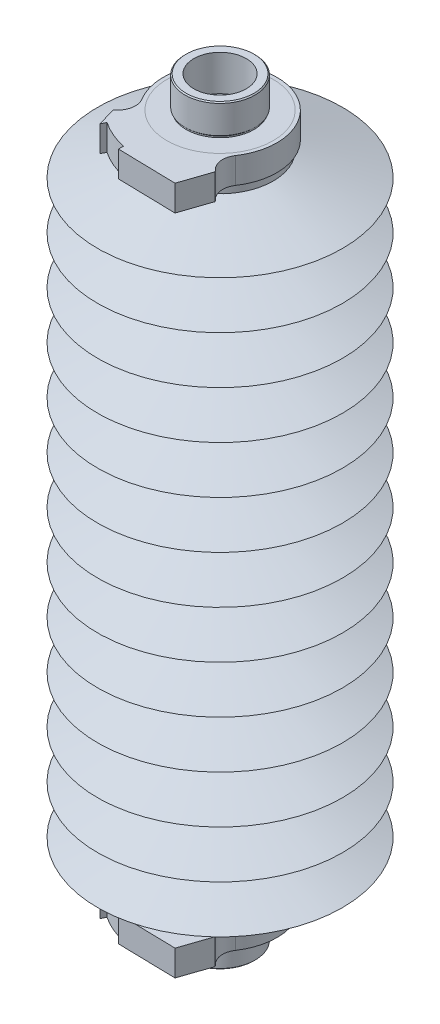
ISO-10303-21;
HEADER;
FILE_DESCRIPTION(('STEP AP214'),'2;1');
FILE_NAME('part.step','',(''),(''),'','','');
FILE_SCHEMA(('AUTOMOTIVE_DESIGN { 1 0 10303 214 1 1 1 1 }'));
ENDSEC;
DATA;
#1=APPLICATION_CONTEXT('core data for automotive mechanical design processes');
#2=APPLICATION_PROTOCOL_DEFINITION('international standard','automotive_design',2000,#1);
#3=PRODUCT_CONTEXT('',#1,'mechanical');
#4=PRODUCT('Part','Part','',(#3));
#5=PRODUCT_RELATED_PRODUCT_CATEGORY('part','',(#4));
#6=PRODUCT_DEFINITION_FORMATION('','',#4);
#7=PRODUCT_DEFINITION_CONTEXT('part definition',#1,'design');
#8=PRODUCT_DEFINITION('design','',#6,#7);
#9=PRODUCT_DEFINITION_SHAPE('','',#8);
#10=(LENGTH_UNIT() NAMED_UNIT(*) SI_UNIT(.MILLI.,.METRE.));
#11=(NAMED_UNIT(*) PLANE_ANGLE_UNIT() SI_UNIT($,.RADIAN.));
#12=(NAMED_UNIT(*) SI_UNIT($,.STERADIAN.) SOLID_ANGLE_UNIT());
#13=UNCERTAINTY_MEASURE_WITH_UNIT(LENGTH_MEASURE(1.E-05),#10,'distance_accuracy_value','');
#14=(GEOMETRIC_REPRESENTATION_CONTEXT(3) GLOBAL_UNCERTAINTY_ASSIGNED_CONTEXT((#13)) GLOBAL_UNIT_ASSIGNED_CONTEXT((#10,
#11,#12)) REPRESENTATION_CONTEXT('',''));
#15=CARTESIAN_POINT('',(0.,0.,0.));
#16=DIRECTION('',(0.,0.,1.));
#17=DIRECTION('',(1.,0.,0.));
#18=AXIS2_PLACEMENT_3D('',#15,#16,#17);
#19=CARTESIAN_POINT('',(-23.0289623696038,257.623700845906,14.0709647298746));
#20=DIRECTION('',(0.,-1.,0.));
#21=DIRECTION('',(0.999748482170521,0.,0.0224270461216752));
#22=AXIS2_PLACEMENT_3D('',#19,#20,#21);
#23=PLANE('',#22);
#24=CARTESIAN_POINT('',(0.,257.623700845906,0.));
#25=DIRECTION('',(0.,1.,0.));
#26=DIRECTION('',(-1.,0.,0.));
#27=AXIS2_PLACEMENT_3D('',#24,#25,#26);
#28=CIRCLE('',#27,12.319);
#29=CARTESIAN_POINT('',(-12.319,257.623700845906,0.));
#30=VERTEX_POINT('',#29);
#31=EDGE_CURVE('E177',#30,#30,#28,.T.);
#32=ORIENTED_EDGE('',*,*,#31,.F.);
#33=EDGE_LOOP('',(#32));
#34=FACE_BOUND('',#33,.T.);
#35=CARTESIAN_POINT('',(0.,257.623700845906,0.));
#36=DIRECTION('',(0.,-1.,0.));
#37=DIRECTION('',(1.,0.,0.));
#38=AXIS2_PLACEMENT_3D('',#35,#36,#37);
#39=CIRCLE('',#38,19.304);
#40=CARTESIAN_POINT('',(19.304,257.623700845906,0.));
#41=VERTEX_POINT('',#40);
#42=EDGE_CURVE('E20',#41,#41,#39,.T.);
#43=ORIENTED_EDGE('',*,*,#42,.F.);
#44=EDGE_LOOP('',(#43));
#45=FACE_BOUND('',#44,.T.);
#46=ADVANCED_FACE('F16',(#34,#45),#23,.F.);
#47=CARTESIAN_POINT('',(-23.0289623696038,248.225700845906,14.0709647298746));
#48=DIRECTION('',(0.,-1.,0.));
#49=DIRECTION('',(0.999748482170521,0.,0.0224270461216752));
#50=AXIS2_PLACEMENT_3D('',#47,#48,#49);
#51=PLANE('',#50);
#52=CARTESIAN_POINT('',(0.,248.225700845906,0.));
#53=DIRECTION('',(0.,-1.,0.));
#54=DIRECTION('',(1.,0.,0.));
#55=AXIS2_PLACEMENT_3D('',#52,#53,#54);
#56=CIRCLE('',#55,19.304);
#57=CARTESIAN_POINT('',(19.304,248.225700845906,0.));
#58=VERTEX_POINT('',#57);
#59=EDGE_CURVE('E11',#58,#58,#56,.T.);
#60=ORIENTED_EDGE('',*,*,#59,.F.);
#61=EDGE_LOOP('',(#60));
#62=FACE_BOUND('',#61,.T.);
#63=DIRECTION('',(-0.279241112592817,0.,-0.960221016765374));
#64=VECTOR('',#63,1.);
#65=CARTESIAN_POINT('',(-17.477680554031,248.225700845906,26.125327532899));
#66=LINE('',#65,#64);
#67=CARTESIAN_POINT('',(-17.477680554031,248.225700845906,26.125327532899));
#68=VERTEX_POINT('',#67);
#69=CARTESIAN_POINT('',(-19.4206741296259,248.225700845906,19.4439930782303));
#70=VERTEX_POINT('',#69);
#71=EDGE_CURVE('E204',#68,#70,#66,.T.);
#72=ORIENTED_EDGE('',*,*,#71,.T.);
#73=DIRECTION('',(0.706682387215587,0.,-0.707530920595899));
#74=VECTOR('',#73,1.);
#75=CARTESIAN_POINT('',(-18.5361410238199,248.225700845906,18.5583978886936));
#76=LINE('',#75,#74);
#77=CARTESIAN_POINT('',(-18.5361410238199,248.225700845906,18.5583978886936));
#78=VERTEX_POINT('',#77);
#79=EDGE_CURVE('E109',#70,#78,#76,.T.);
#80=ORIENTED_EDGE('',*,*,#79,.T.);
#81=CARTESIAN_POINT('',(-23.0289623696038,248.225700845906,14.0709647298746));
#82=DIRECTION('',(0.,1.,0.));
#83=DIRECTION('',(0.999748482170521,0.,0.0224270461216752));
#84=AXIS2_PLACEMENT_3D('',#81,#82,#83);
#85=CIRCLE('',#84,6.34999999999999);
#86=CARTESIAN_POINT('',(-17.6103829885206,248.225700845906,10.7601494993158));
#87=VERTEX_POINT('',#86);
#88=EDGE_CURVE('E272',#78,#87,#85,.T.);
#89=ORIENTED_EDGE('',*,*,#88,.T.);
#90=CARTESIAN_POINT('',(0.,248.225700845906,0.));
#91=DIRECTION('',(0.,-1.,0.));
#92=DIRECTION('',(0.999748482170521,0.,0.0224270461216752));
#93=AXIS2_PLACEMENT_3D('',#90,#91,#92);
#94=CIRCLE('',#93,20.6375);
#95=CARTESIAN_POINT('',(17.110152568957,248.225700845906,11.5390244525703));
#96=VERTEX_POINT('',#95);
#97=EDGE_CURVE('E275',#87,#96,#94,.T.);
#98=ORIENTED_EDGE('',*,*,#97,.T.);
#99=CARTESIAN_POINT('',(22.3748148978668,248.225700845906,15.0894935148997));
#100=DIRECTION('',(0.,1.,0.));
#101=DIRECTION('',(0.999748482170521,0.,0.0224270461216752));
#102=AXIS2_PLACEMENT_3D('',#99,#100,#101);
#103=CIRCLE('',#102,6.34999999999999);
#104=CARTESIAN_POINT('',(17.6852839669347,248.225700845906,19.3709418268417));
#105=VERTEX_POINT('',#104);
#106=EDGE_CURVE('E280',#96,#105,#103,.T.);
#107=ORIENTED_EDGE('',*,*,#106,.T.);
#108=DIRECTION('',(0.674243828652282,0.,0.738508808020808));
#109=VECTOR('',#108,1.);
#110=CARTESIAN_POINT('',(17.6852839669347,248.225700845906,19.3709418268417));
#111=LINE('',#110,#109);
#112=CARTESIAN_POINT('',(18.5292147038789,248.225700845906,20.2953111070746));
#113=VERTEX_POINT('',#112);
#114=EDGE_CURVE('E287',#105,#113,#111,.T.);
#115=ORIENTED_EDGE('',*,*,#114,.T.);
#116=DIRECTION('',(-0.322019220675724,0.,0.9467331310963));
#117=VECTOR('',#116,1.);
#118=CARTESIAN_POINT('',(14.8244506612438,248.225700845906,31.1872785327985));
#119=LINE('',#118,#117);
#120=CARTESIAN_POINT('',(14.8244506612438,248.225700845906,31.1872785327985));
#121=VERTEX_POINT('',#120);
#122=EDGE_CURVE('E290',#113,#121,#119,.T.);
#123=ORIENTED_EDGE('',*,*,#122,.T.);
#124=DIRECTION('',(-0.999748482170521,0.,-0.0224270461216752));
#125=VECTOR('',#124,1.);
#126=CARTESIAN_POINT('',(14.8244506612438,248.225700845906,31.1872785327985));
#127=LINE('',#126,#125);
#128=CARTESIAN_POINT('',(-6.19162849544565,248.225700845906,30.7158313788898));
#129=VERTEX_POINT('',#128);
#130=EDGE_CURVE('E148',#121,#129,#127,.T.);
#131=ORIENTED_EDGE('',*,*,#130,.T.);
#132=DIRECTION('',(0.0224270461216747,0.,-0.999748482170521));
#133=VECTOR('',#132,1.);
#134=CARTESIAN_POINT('',(-6.19162849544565,248.225700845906,30.7158313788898));
#135=LINE('',#134,#133);
#136=CARTESIAN_POINT('',(-6.15102212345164,248.225700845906,28.9056884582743));
#137=VERTEX_POINT('',#136);
#138=EDGE_CURVE('E142',#129,#137,#135,.T.);
#139=ORIENTED_EDGE('',*,*,#138,.T.);
#140=CARTESIAN_POINT('',(0.,248.225700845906,0.));
#141=DIRECTION('',(0.,-1.,0.));
#142=DIRECTION('',(0.999748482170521,0.,0.0224270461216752));
#143=AXIS2_PLACEMENT_3D('',#140,#141,#142);
#144=CIRCLE('',#143,29.5529);
#145=CARTESIAN_POINT('',(-16.6074541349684,248.225700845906,24.4451705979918));
#146=VERTEX_POINT('',#145);
#147=EDGE_CURVE('E146',#137,#146,#144,.T.);
#148=ORIENTED_EDGE('',*,*,#147,.T.);
#149=DIRECTION('',(-0.459914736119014,0.,0.88796308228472));
#150=VECTOR('',#149,1.);
#151=CARTESIAN_POINT('',(-17.477680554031,248.225700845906,26.125327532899));
#152=LINE('',#151,#150);
#153=EDGE_CURVE('E39',#146,#68,#152,.T.);
#154=ORIENTED_EDGE('',*,*,#153,.T.);
#155=EDGE_LOOP('',(#72,#80,#89,#98,#107,#115,#123,#131,#139,#148,#154));
#156=FACE_BOUND('',#155,.T.);
#157=ADVANCED_FACE('F144',(#62,#156),#51,.T.);
#158=ORIENTED_EDGE('',*,*,#42,.T.);
#159=EDGE_LOOP('',(#158));
#160=FACE_BOUND('',#159,.T.);
#161=DIRECTION('',(-0.279241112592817,0.,-0.960221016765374));
#162=VECTOR('',#161,1.);
#163=CARTESIAN_POINT('',(-17.4776805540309,257.623700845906,26.125327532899));
#164=LINE('',#163,#162);
#165=CARTESIAN_POINT('',(-17.4776805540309,257.623700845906,26.125327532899));
#166=VERTEX_POINT('',#165);
#167=CARTESIAN_POINT('',(-19.4206741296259,257.623700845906,19.4439930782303));
#168=VERTEX_POINT('',#167);
#169=EDGE_CURVE('E172',#166,#168,#164,.T.);
#170=ORIENTED_EDGE('',*,*,#169,.F.);
#171=DIRECTION('',(-0.459914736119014,0.,0.88796308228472));
#172=VECTOR('',#171,1.);
#173=CARTESIAN_POINT('',(-17.4776805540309,257.623700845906,26.125327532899));
#174=LINE('',#173,#172);
#175=CARTESIAN_POINT('',(-16.6074541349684,257.623700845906,24.4451705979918));
#176=VERTEX_POINT('',#175);
#177=EDGE_CURVE('E98',#176,#166,#174,.T.);
#178=ORIENTED_EDGE('',*,*,#177,.F.);
#179=CARTESIAN_POINT('',(0.,257.623700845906,0.));
#180=DIRECTION('',(0.,-1.,0.));
#181=DIRECTION('',(0.999748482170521,0.,0.0224270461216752));
#182=AXIS2_PLACEMENT_3D('',#179,#180,#181);
#183=CIRCLE('',#182,29.5529);
#184=CARTESIAN_POINT('',(-6.15102212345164,257.623700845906,28.9056884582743));
#185=VERTEX_POINT('',#184);
#186=EDGE_CURVE('E90',#185,#176,#183,.T.);
#187=ORIENTED_EDGE('',*,*,#186,.F.);
#188=DIRECTION('',(0.0224270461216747,0.,-0.999748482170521));
#189=VECTOR('',#188,1.);
#190=CARTESIAN_POINT('',(-6.19162849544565,257.623700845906,30.7158313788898));
#191=LINE('',#190,#189);
#192=CARTESIAN_POINT('',(-6.19162849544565,257.623700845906,30.7158313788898));
#193=VERTEX_POINT('',#192);
#194=EDGE_CURVE('E157',#193,#185,#191,.T.);
#195=ORIENTED_EDGE('',*,*,#194,.F.);
#196=DIRECTION('',(-0.999748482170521,0.,-0.0224270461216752));
#197=VECTOR('',#196,1.);
#198=CARTESIAN_POINT('',(14.8244506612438,257.623700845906,31.1872785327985));
#199=LINE('',#198,#197);
#200=CARTESIAN_POINT('',(14.8244506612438,257.623700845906,31.1872785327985));
#201=VERTEX_POINT('',#200);
#202=EDGE_CURVE('E195',#201,#193,#199,.T.);
#203=ORIENTED_EDGE('',*,*,#202,.F.);
#204=DIRECTION('',(-0.322019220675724,0.,0.9467331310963));
#205=VECTOR('',#204,1.);
#206=CARTESIAN_POINT('',(14.8244506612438,257.623700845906,31.1872785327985));
#207=LINE('',#206,#205);
#208=CARTESIAN_POINT('',(18.5292147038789,257.623700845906,20.2953111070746));
#209=VERTEX_POINT('',#208);
#210=EDGE_CURVE('E192',#209,#201,#207,.T.);
#211=ORIENTED_EDGE('',*,*,#210,.F.);
#212=DIRECTION('',(0.674243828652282,0.,0.738508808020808));
#213=VECTOR('',#212,1.);
#214=CARTESIAN_POINT('',(17.6852839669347,257.623700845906,19.3709418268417));
#215=LINE('',#214,#213);
#216=CARTESIAN_POINT('',(17.6852839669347,257.623700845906,19.3709418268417));
#217=VERTEX_POINT('',#216);
#218=EDGE_CURVE('E189',#217,#209,#215,.T.);
#219=ORIENTED_EDGE('',*,*,#218,.F.);
#220=CARTESIAN_POINT('',(22.3748148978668,257.623700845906,15.0894935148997));
#221=DIRECTION('',(0.,1.,0.));
#222=DIRECTION('',(0.999748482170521,0.,0.0224270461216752));
#223=AXIS2_PLACEMENT_3D('',#220,#221,#222);
#224=CIRCLE('',#223,6.34999999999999);
#225=CARTESIAN_POINT('',(17.110152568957,257.623700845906,11.5390244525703));
#226=VERTEX_POINT('',#225);
#227=EDGE_CURVE('E186',#226,#217,#224,.T.);
#228=ORIENTED_EDGE('',*,*,#227,.F.);
#229=CARTESIAN_POINT('',(0.,257.623700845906,0.));
#230=DIRECTION('',(0.,-1.,0.));
#231=DIRECTION('',(0.999748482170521,0.,0.0224270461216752));
#232=AXIS2_PLACEMENT_3D('',#229,#230,#231);
#233=CIRCLE('',#232,20.6375);
#234=CARTESIAN_POINT('',(-17.6103829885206,257.623700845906,10.7601494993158));
#235=VERTEX_POINT('',#234);
#236=EDGE_CURVE('E183',#235,#226,#233,.T.);
#237=ORIENTED_EDGE('',*,*,#236,.F.);
#238=CARTESIAN_POINT('',(-23.0289623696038,257.623700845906,14.0709647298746));
#239=DIRECTION('',(0.,1.,0.));
#240=DIRECTION('',(0.999748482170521,0.,0.0224270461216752));
#241=AXIS2_PLACEMENT_3D('',#238,#239,#240);
#242=CIRCLE('',#241,6.34999999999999);
#243=CARTESIAN_POINT('',(-18.5361410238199,257.623700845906,18.5583978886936));
#244=VERTEX_POINT('',#243);
#245=EDGE_CURVE('E180',#244,#235,#242,.T.);
#246=ORIENTED_EDGE('',*,*,#245,.F.);
#247=DIRECTION('',(0.706682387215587,0.,-0.707530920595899));
#248=VECTOR('',#247,1.);
#249=CARTESIAN_POINT('',(-18.5361410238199,257.623700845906,18.5583978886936));
#250=LINE('',#249,#248);
#251=EDGE_CURVE('E176',#168,#244,#250,.T.);
#252=ORIENTED_EDGE('',*,*,#251,.F.);
#253=EDGE_LOOP('',(#170,#178,#187,#195,#203,#211,#219,#228,#237,#246,#252));
#254=FACE_BOUND('',#253,.T.);
#255=ADVANCED_FACE('F241',(#160,#254),#23,.F.);
#256=CARTESIAN_POINT('',(-17.477680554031,248.225700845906,26.125327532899));
#257=DIRECTION('',(0.960221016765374,0.,-0.279241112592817));
#258=DIRECTION('',(0.279241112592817,0.,0.960221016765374));
#259=AXIS2_PLACEMENT_3D('',#256,#257,#258);
#260=PLANE('',#259);
#261=ORIENTED_EDGE('',*,*,#169,.T.);
#262=DIRECTION('',(0.,1.,0.));
#263=VECTOR('',#262,1.);
#264=CARTESIAN_POINT('',(-19.4206741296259,248.225700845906,19.4439930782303));
#265=LINE('',#264,#263);
#266=EDGE_CURVE('E234',#70,#168,#265,.T.);
#267=ORIENTED_EDGE('',*,*,#266,.F.);
#268=ORIENTED_EDGE('',*,*,#71,.F.);
#269=DIRECTION('',(0.,1.,0.));
#270=VECTOR('',#269,1.);
#271=CARTESIAN_POINT('',(-17.477680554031,248.225700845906,26.125327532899));
#272=LINE('',#271,#270);
#273=EDGE_CURVE('E168',#68,#166,#272,.T.);
#274=ORIENTED_EDGE('',*,*,#273,.T.);
#275=EDGE_LOOP('',(#261,#267,#268,#274));
#276=FACE_BOUND('',#275,.T.);
#277=ADVANCED_FACE('F18',(#276),#260,.F.);
#278=CARTESIAN_POINT('',(-18.5361410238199,248.225700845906,18.5583978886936));
#279=DIRECTION('',(0.707530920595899,0.,0.706682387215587));
#280=DIRECTION('',(-0.706682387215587,0.,0.707530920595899));
#281=AXIS2_PLACEMENT_3D('',#278,#279,#280);
#282=PLANE('',#281);
#283=ORIENTED_EDGE('',*,*,#251,.T.);
#284=DIRECTION('',(0.,1.,0.));
#285=VECTOR('',#284,1.);
#286=CARTESIAN_POINT('',(-18.5361410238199,248.225700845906,18.5583978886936));
#287=LINE('',#286,#285);
#288=EDGE_CURVE('E231',#78,#244,#287,.T.);
#289=ORIENTED_EDGE('',*,*,#288,.F.);
#290=ORIENTED_EDGE('',*,*,#79,.F.);
#291=ORIENTED_EDGE('',*,*,#266,.T.);
#292=EDGE_LOOP('',(#283,#289,#290,#291));
#293=FACE_BOUND('',#292,.T.);
#294=ADVANCED_FACE('F259',(#293),#282,.F.);
#295=CARTESIAN_POINT('',(-23.0289623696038,248.225700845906,14.0709647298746));
#296=DIRECTION('',(0.,1.,0.));
#297=DIRECTION('',(-0.999748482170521,0.,-0.0224270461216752));
#298=AXIS2_PLACEMENT_3D('',#295,#296,#297);
#299=CYLINDRICAL_SURFACE('',#298,6.34999999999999);
#300=ORIENTED_EDGE('',*,*,#245,.T.);
#301=DIRECTION('',(0.,1.,0.));
#302=VECTOR('',#301,1.);
#303=CARTESIAN_POINT('',(-17.6103829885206,248.225700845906,10.7601494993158));
#304=LINE('',#303,#302);
#305=EDGE_CURVE('E227',#87,#235,#304,.T.);
#306=ORIENTED_EDGE('',*,*,#305,.F.);
#307=ORIENTED_EDGE('',*,*,#88,.F.);
#308=ORIENTED_EDGE('',*,*,#288,.T.);
#309=EDGE_LOOP('',(#300,#306,#307,#308));
#310=FACE_BOUND('',#309,.T.);
#311=ADVANCED_FACE('F264',(#310),#299,.F.);
#312=CARTESIAN_POINT('',(0.,248.225700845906,0.));
#313=DIRECTION('',(0.,1.,0.));
#314=DIRECTION('',(-0.999748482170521,0.,-0.0224270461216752));
#315=AXIS2_PLACEMENT_3D('',#312,#313,#314);
#316=CYLINDRICAL_SURFACE('',#315,20.6375);
#317=ORIENTED_EDGE('',*,*,#236,.T.);
#318=DIRECTION('',(0.,1.,0.));
#319=VECTOR('',#318,1.);
#320=CARTESIAN_POINT('',(17.110152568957,248.225700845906,11.5390244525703));
#321=LINE('',#320,#319);
#322=EDGE_CURVE('E223',#96,#226,#321,.T.);
#323=ORIENTED_EDGE('',*,*,#322,.F.);
#324=ORIENTED_EDGE('',*,*,#97,.F.);
#325=ORIENTED_EDGE('',*,*,#305,.T.);
#326=EDGE_LOOP('',(#317,#323,#324,#325));
#327=FACE_BOUND('',#326,.T.);
#328=ADVANCED_FACE('F1509',(#327),#316,.T.);
#329=CARTESIAN_POINT('',(22.3748148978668,248.225700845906,15.0894935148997));
#330=DIRECTION('',(0.,1.,0.));
#331=DIRECTION('',(-0.999748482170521,0.,-0.0224270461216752));
#332=AXIS2_PLACEMENT_3D('',#329,#330,#331);
#333=CYLINDRICAL_SURFACE('',#332,6.34999999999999);
#334=ORIENTED_EDGE('',*,*,#227,.T.);
#335=DIRECTION('',(0.,1.,0.));
#336=VECTOR('',#335,1.);
#337=CARTESIAN_POINT('',(17.6852839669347,248.225700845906,19.3709418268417));
#338=LINE('',#337,#336);
#339=EDGE_CURVE('E219',#105,#217,#338,.T.);
#340=ORIENTED_EDGE('',*,*,#339,.F.);
#341=ORIENTED_EDGE('',*,*,#106,.F.);
#342=ORIENTED_EDGE('',*,*,#322,.T.);
#343=EDGE_LOOP('',(#334,#340,#341,#342));
#344=FACE_BOUND('',#343,.T.);
#345=ADVANCED_FACE('F1497',(#344),#333,.F.);
#346=CARTESIAN_POINT('',(17.6852839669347,248.225700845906,19.3709418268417));
#347=DIRECTION('',(-0.738508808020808,0.,0.674243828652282));
#348=DIRECTION('',(-0.674243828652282,0.,-0.738508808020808));
#349=AXIS2_PLACEMENT_3D('',#346,#347,#348);
#350=PLANE('',#349);
#351=ORIENTED_EDGE('',*,*,#218,.T.);
#352=DIRECTION('',(0.,1.,0.));
#353=VECTOR('',#352,1.);
#354=CARTESIAN_POINT('',(18.5292147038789,248.225700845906,20.2953111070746));
#355=LINE('',#354,#353);
#356=EDGE_CURVE('E215',#113,#209,#355,.T.);
#357=ORIENTED_EDGE('',*,*,#356,.F.);
#358=ORIENTED_EDGE('',*,*,#114,.F.);
#359=ORIENTED_EDGE('',*,*,#339,.T.);
#360=EDGE_LOOP('',(#351,#357,#358,#359));
#361=FACE_BOUND('',#360,.T.);
#362=ADVANCED_FACE('F1485',(#361),#350,.F.);
#363=CARTESIAN_POINT('',(14.8244506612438,248.225700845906,31.1872785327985));
#364=DIRECTION('',(-0.9467331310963,0.,-0.322019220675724));
#365=DIRECTION('',(0.322019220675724,0.,-0.9467331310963));
#366=AXIS2_PLACEMENT_3D('',#363,#364,#365);
#367=PLANE('',#366);
#368=ORIENTED_EDGE('',*,*,#210,.T.);
#369=DIRECTION('',(0.,1.,0.));
#370=VECTOR('',#369,1.);
#371=CARTESIAN_POINT('',(14.8244506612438,248.225700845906,31.1872785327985));
#372=LINE('',#371,#370);
#373=EDGE_CURVE('E211',#121,#201,#372,.T.);
#374=ORIENTED_EDGE('',*,*,#373,.F.);
#375=ORIENTED_EDGE('',*,*,#122,.F.);
#376=ORIENTED_EDGE('',*,*,#356,.T.);
#377=EDGE_LOOP('',(#368,#374,#375,#376));
#378=FACE_BOUND('',#377,.T.);
#379=ADVANCED_FACE('F1473',(#378),#367,.F.);
#380=CARTESIAN_POINT('',(14.8244506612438,248.225700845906,31.1872785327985));
#381=DIRECTION('',(0.0224270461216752,0.,-0.999748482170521));
#382=DIRECTION('',(0.,1.,0.));
#383=AXIS2_PLACEMENT_3D('',#380,#381,#382);
#384=PLANE('',#383);
#385=ORIENTED_EDGE('',*,*,#202,.T.);
#386=DIRECTION('',(0.,1.,0.));
#387=VECTOR('',#386,1.);
#388=CARTESIAN_POINT('',(-6.19162849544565,248.225700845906,30.7158313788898));
#389=LINE('',#388,#387);
#390=EDGE_CURVE('E159',#129,#193,#389,.T.);
#391=ORIENTED_EDGE('',*,*,#390,.F.);
#392=ORIENTED_EDGE('',*,*,#130,.F.);
#393=ORIENTED_EDGE('',*,*,#373,.T.);
#394=EDGE_LOOP('',(#385,#391,#392,#393));
#395=FACE_BOUND('',#394,.T.);
#396=ADVANCED_FACE('F1462',(#395),#384,.F.);
#397=CARTESIAN_POINT('',(-6.19162849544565,248.225700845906,30.7158313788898));
#398=DIRECTION('',(0.999748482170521,0.,0.0224270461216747));
#399=DIRECTION('',(-0.0224270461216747,0.,0.999748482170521));
#400=AXIS2_PLACEMENT_3D('',#397,#398,#399);
#401=PLANE('',#400);
#402=ORIENTED_EDGE('',*,*,#194,.T.);
#403=DIRECTION('',(0.,1.,0.));
#404=VECTOR('',#403,1.);
#405=CARTESIAN_POINT('',(-6.15102212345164,248.225700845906,28.9056884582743));
#406=LINE('',#405,#404);
#407=EDGE_CURVE('E154',#137,#185,#406,.T.);
#408=ORIENTED_EDGE('',*,*,#407,.F.);
#409=ORIENTED_EDGE('',*,*,#138,.F.);
#410=ORIENTED_EDGE('',*,*,#390,.T.);
#411=EDGE_LOOP('',(#402,#408,#409,#410));
#412=FACE_BOUND('',#411,.T.);
#413=ADVANCED_FACE('F155',(#412),#401,.F.);
#414=CARTESIAN_POINT('',(0.,248.225700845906,0.));
#415=DIRECTION('',(0.,1.,0.));
#416=DIRECTION('',(-0.999748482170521,0.,-0.0224270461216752));
#417=AXIS2_PLACEMENT_3D('',#414,#415,#416);
#418=CYLINDRICAL_SURFACE('',#417,29.5529);
#419=ORIENTED_EDGE('',*,*,#186,.T.);
#420=DIRECTION('',(0.,1.,0.));
#421=VECTOR('',#420,1.);
#422=CARTESIAN_POINT('',(-16.6074541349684,248.225700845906,24.4451705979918));
#423=LINE('',#422,#421);
#424=EDGE_CURVE('E160',#146,#176,#423,.T.);
#425=ORIENTED_EDGE('',*,*,#424,.F.);
#426=ORIENTED_EDGE('',*,*,#147,.F.);
#427=ORIENTED_EDGE('',*,*,#407,.T.);
#428=EDGE_LOOP('',(#419,#425,#426,#427));
#429=FACE_BOUND('',#428,.T.);
#430=ADVANCED_FACE('F162',(#429),#418,.T.);
#431=CARTESIAN_POINT('',(-17.477680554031,248.225700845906,26.125327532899));
#432=DIRECTION('',(-0.88796308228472,0.,-0.459914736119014));
#433=DIRECTION('',(0.459914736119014,0.,-0.88796308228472));
#434=AXIS2_PLACEMENT_3D('',#431,#432,#433);
#435=PLANE('',#434);
#436=ORIENTED_EDGE('',*,*,#177,.T.);
#437=ORIENTED_EDGE('',*,*,#273,.F.);
#438=ORIENTED_EDGE('',*,*,#153,.F.);
#439=ORIENTED_EDGE('',*,*,#424,.T.);
#440=EDGE_LOOP('',(#436,#437,#438,#439));
#441=FACE_BOUND('',#440,.T.);
#442=ADVANCED_FACE('F1431',(#441),#435,.F.);
#443=CARTESIAN_POINT('',(4.37335030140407,269.053700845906,11.516577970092));
#444=DIRECTION('',(0.,1.,0.));
#445=DIRECTION('',(-0.934863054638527,0.,0.355008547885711));
#446=AXIS2_PLACEMENT_3D('',#443,#444,#445);
#447=PLANE('',#446);
#448=CARTESIAN_POINT('',(0.,269.053700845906,0.));
#449=DIRECTION('',(0.,-1.,0.));
#450=DIRECTION('',(0.934863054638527,0.,-0.355008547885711));
#451=AXIS2_PLACEMENT_3D('',#448,#449,#450);
#452=CIRCLE('',#451,9.525);
#453=CARTESIAN_POINT('',(8.90457059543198,269.053700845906,-3.38145641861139));
#454=VERTEX_POINT('',#453);
#455=EDGE_CURVE('E756',#454,#454,#452,.T.);
#456=ORIENTED_EDGE('',*,*,#455,.T.);
#457=EDGE_LOOP('',(#456));
#458=FACE_BOUND('',#457,.T.);
#459=CARTESIAN_POINT('',(0.,269.053700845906,0.));
#460=DIRECTION('',(0.,-1.,0.));
#461=DIRECTION('',(0.934863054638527,0.,-0.355008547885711));
#462=AXIS2_PLACEMENT_3D('',#459,#460,#461);
#463=CIRCLE('',#462,12.319);
#464=CARTESIAN_POINT('',(11.516577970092,269.053700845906,-4.37335030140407));
#465=VERTEX_POINT('',#464);
#466=EDGE_CURVE('E698',#465,#465,#463,.T.);
#467=ORIENTED_EDGE('',*,*,#466,.F.);
#468=EDGE_LOOP('',(#467));
#469=FACE_BOUND('',#468,.T.);
#470=ADVANCED_FACE('F1421',(#458,#469),#447,.T.);
#471=CARTESIAN_POINT('',(0.,268.672700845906,0.));
#472=DIRECTION('',(0.,-1.,0.));
#473=DIRECTION('',(0.934863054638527,0.,-0.355008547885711));
#474=AXIS2_PLACEMENT_3D('',#471,#472,#473);
#475=CONICAL_SURFACE('',#474,12.7,0.785398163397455);
#476=ORIENTED_EDGE('',*,*,#466,.T.);
#477=EDGE_LOOP('',(#476));
#478=FACE_BOUND('',#477,.T.);
#479=CARTESIAN_POINT('',(0.,268.672700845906,0.));
#480=DIRECTION('',(0.,-1.,0.));
#481=DIRECTION('',(0.934863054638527,0.,-0.355008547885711));
#482=AXIS2_PLACEMENT_3D('',#479,#480,#481);
#483=CIRCLE('',#482,12.7);
#484=CARTESIAN_POINT('',(11.8727607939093,268.672700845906,-4.50860855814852));
#485=VERTEX_POINT('',#484);
#486=EDGE_CURVE('E738',#485,#485,#483,.T.);
#487=ORIENTED_EDGE('',*,*,#486,.F.);
#488=EDGE_LOOP('',(#487));
#489=FACE_BOUND('',#488,.T.);
#490=ADVANCED_FACE('F1409',(#478,#489),#475,.T.);
#491=CARTESIAN_POINT('',(0.,222.412950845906,0.));
#492=DIRECTION('',(0.,-1.,0.));
#493=DIRECTION('',(0.934863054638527,0.,-0.355008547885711));
#494=AXIS2_PLACEMENT_3D('',#491,#492,#493);
#495=CYLINDRICAL_SURFACE('',#494,12.7);
#496=ORIENTED_EDGE('',*,*,#486,.T.);
#497=EDGE_LOOP('',(#496));
#498=FACE_BOUND('',#497,.T.);
#499=CARTESIAN_POINT('',(0.,258.512700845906,0.));
#500=DIRECTION('',(0.,-1.,0.));
#501=DIRECTION('',(0.934863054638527,0.,-0.355008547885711));
#502=AXIS2_PLACEMENT_3D('',#499,#500,#501);
#503=CIRCLE('',#502,12.7);
#504=CARTESIAN_POINT('',(11.8727607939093,258.512700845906,-4.50860855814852));
#505=VERTEX_POINT('',#504);
#506=EDGE_CURVE('E744',#505,#505,#503,.T.);
#507=ORIENTED_EDGE('',*,*,#506,.F.);
#508=EDGE_LOOP('',(#507));
#509=FACE_BOUND('',#508,.T.);
#510=ADVANCED_FACE('F1397',(#498,#509),#495,.T.);
#511=CARTESIAN_POINT('',(0.,258.131700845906,0.));
#512=DIRECTION('',(0.,1.,0.));
#513=DIRECTION('',(-0.934863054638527,0.,0.355008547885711));
#514=AXIS2_PLACEMENT_3D('',#511,#512,#513);
#515=CONICAL_SURFACE('',#514,12.319,0.785398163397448);
#516=ORIENTED_EDGE('',*,*,#506,.T.);
#517=EDGE_LOOP('',(#516));
#518=FACE_BOUND('',#517,.T.);
#519=CARTESIAN_POINT('',(0.,258.131700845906,0.));
#520=DIRECTION('',(0.,-1.,0.));
#521=DIRECTION('',(0.934863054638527,0.,-0.355008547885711));
#522=AXIS2_PLACEMENT_3D('',#519,#520,#521);
#523=CIRCLE('',#522,12.319);
#524=CARTESIAN_POINT('',(11.516577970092,258.131700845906,-4.37335030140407));
#525=VERTEX_POINT('',#524);
#526=EDGE_CURVE('E750',#525,#525,#523,.T.);
#527=ORIENTED_EDGE('',*,*,#526,.F.);
#528=EDGE_LOOP('',(#527));
#529=FACE_BOUND('',#528,.T.);
#530=ADVANCED_FACE('F1387',(#518,#529),#515,.T.);
#531=CARTESIAN_POINT('',(0.,222.412950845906,0.));
#532=DIRECTION('',(0.,-1.,0.));
#533=DIRECTION('',(0.934863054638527,0.,-0.355008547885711));
#534=AXIS2_PLACEMENT_3D('',#531,#532,#533);
#535=CYLINDRICAL_SURFACE('',#534,12.319);
#536=ORIENTED_EDGE('',*,*,#526,.T.);
#537=EDGE_LOOP('',(#536));
#538=FACE_BOUND('',#537,.T.);
#539=ORIENTED_EDGE('',*,*,#31,.T.);
#540=EDGE_LOOP('',(#539));
#541=FACE_BOUND('',#540,.T.);
#542=ADVANCED_FACE('F1375',(#538,#541),#535,.T.);
#543=CARTESIAN_POINT('',(0.,7.62370084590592,0.));
#544=DIRECTION('',(0.,-1.,0.));
#545=DIRECTION('',(1.,0.,0.));
#546=AXIS2_PLACEMENT_3D('',#543,#544,#545);
#547=CYLINDRICAL_SURFACE('',#546,19.304);
#548=CARTESIAN_POINT('',(0.,20.3237008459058,0.));
#549=DIRECTION('',(0.,-1.,0.));
#550=DIRECTION('',(1.,0.,0.));
#551=AXIS2_PLACEMENT_3D('',#548,#549,#550);
#552=CIRCLE('',#551,19.304);
#553=CARTESIAN_POINT('',(19.304,20.3237008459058,0.));
#554=VERTEX_POINT('',#553);
#555=EDGE_CURVE('E336',#554,#554,#552,.T.);
#556=ORIENTED_EDGE('',*,*,#555,.T.);
#557=EDGE_LOOP('',(#556));
#558=FACE_BOUND('',#557,.T.);
#559=CARTESIAN_POINT('',(0.,17.0217008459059,0.));
#560=DIRECTION('',(0.,-1.,0.));
#561=DIRECTION('',(1.,0.,0.));
#562=AXIS2_PLACEMENT_3D('',#559,#560,#561);
#563=CIRCLE('',#562,19.304);
#564=CARTESIAN_POINT('',(19.304,17.0217008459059,0.));
#565=VERTEX_POINT('',#564);
#566=EDGE_CURVE('E627',#565,#565,#563,.F.);
#567=ORIENTED_EDGE('',*,*,#566,.T.);
#568=EDGE_LOOP('',(#567));
#569=FACE_BOUND('',#568,.T.);
#570=ADVANCED_FACE('F1363',(#558,#569),#547,.T.);
#571=CARTESIAN_POINT('',(0.,20.3237008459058,0.));
#572=DIRECTION('',(0.,1.,0.));
#573=DIRECTION('',(-1.,0.,0.));
#574=AXIS2_PLACEMENT_3D('',#571,#572,#573);
#575=CONICAL_SURFACE('',#574,19.304,1.23989501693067);
#576=CARTESIAN_POINT('',(0.,28.9621623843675,0.));
#577=DIRECTION('',(0.,-1.,0.));
#578=DIRECTION('',(1.,0.,0.));
#579=AXIS2_PLACEMENT_3D('',#576,#577,#578);
#580=CIRCLE('',#579,44.45);
#581=CARTESIAN_POINT('',(44.45,28.9621623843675,0.));
#582=VERTEX_POINT('',#581);
#583=EDGE_CURVE('E340',#582,#582,#580,.T.);
#584=ORIENTED_EDGE('',*,*,#583,.T.);
#585=EDGE_LOOP('',(#584));
#586=FACE_BOUND('',#585,.T.);
#587=ORIENTED_EDGE('',*,*,#555,.F.);
#588=EDGE_LOOP('',(#587));
#589=FACE_BOUND('',#588,.T.);
#590=ADVANCED_FACE('F1352',(#586,#589),#575,.T.);
#591=CARTESIAN_POINT('',(0.,28.9621623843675,0.));
#592=DIRECTION('',(0.,-1.,0.));
#593=DIRECTION('',(1.,0.,0.));
#594=AXIS2_PLACEMENT_3D('',#591,#592,#593);
#595=CONICAL_SURFACE('',#594,44.45,1.23989501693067);
#596=CARTESIAN_POINT('',(0.,37.600623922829,0.));
#597=DIRECTION('',(0.,-1.,0.));
#598=DIRECTION('',(1.,0.,0.));
#599=AXIS2_PLACEMENT_3D('',#596,#597,#598);
#600=CIRCLE('',#599,19.304);
#601=CARTESIAN_POINT('',(19.304,37.600623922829,0.));
#602=VERTEX_POINT('',#601);
#603=EDGE_CURVE('E347',#602,#602,#600,.T.);
#604=ORIENTED_EDGE('',*,*,#603,.T.);
#605=EDGE_LOOP('',(#604));
#606=FACE_BOUND('',#605,.T.);
#607=ORIENTED_EDGE('',*,*,#583,.F.);
#608=EDGE_LOOP('',(#607));
#609=FACE_BOUND('',#608,.T.);
#610=ADVANCED_FACE('F1341',(#606,#609),#595,.T.);
#611=CARTESIAN_POINT('',(0.,37.600623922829,0.));
#612=DIRECTION('',(0.,1.,0.));
#613=DIRECTION('',(-1.,0.,0.));
#614=AXIS2_PLACEMENT_3D('',#611,#612,#613);
#615=CONICAL_SURFACE('',#614,19.304,1.23989501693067);
#616=CARTESIAN_POINT('',(0.,46.2390854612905,0.));
#617=DIRECTION('',(0.,-1.,0.));
#618=DIRECTION('',(1.,0.,0.));
#619=AXIS2_PLACEMENT_3D('',#616,#617,#618);
#620=CIRCLE('',#619,44.45);
#621=CARTESIAN_POINT('',(44.45,46.2390854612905,0.));
#622=VERTEX_POINT('',#621);
#623=EDGE_CURVE('E353',#622,#622,#620,.T.);
#624=ORIENTED_EDGE('',*,*,#623,.T.);
#625=EDGE_LOOP('',(#624));
#626=FACE_BOUND('',#625,.T.);
#627=ORIENTED_EDGE('',*,*,#603,.F.);
#628=EDGE_LOOP('',(#627));
#629=FACE_BOUND('',#628,.T.);
#630=ADVANCED_FACE('F1330',(#626,#629),#615,.T.);
#631=CARTESIAN_POINT('',(0.,46.2390854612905,0.));
#632=DIRECTION('',(0.,-1.,0.));
#633=DIRECTION('',(1.,0.,0.));
#634=AXIS2_PLACEMENT_3D('',#631,#632,#633);
#635=CONICAL_SURFACE('',#634,44.45,1.23989501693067);
#636=CARTESIAN_POINT('',(0.,54.8775469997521,0.));
#637=DIRECTION('',(0.,-1.,0.));
#638=DIRECTION('',(1.,0.,0.));
#639=AXIS2_PLACEMENT_3D('',#636,#637,#638);
#640=CIRCLE('',#639,19.304);
#641=CARTESIAN_POINT('',(19.304,54.8775469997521,0.));
#642=VERTEX_POINT('',#641);
#643=EDGE_CURVE('E359',#642,#642,#640,.T.);
#644=ORIENTED_EDGE('',*,*,#643,.T.);
#645=EDGE_LOOP('',(#644));
#646=FACE_BOUND('',#645,.T.);
#647=ORIENTED_EDGE('',*,*,#623,.F.);
#648=EDGE_LOOP('',(#647));
#649=FACE_BOUND('',#648,.T.);
#650=ADVANCED_FACE('F1319',(#646,#649),#635,.T.);
#651=CARTESIAN_POINT('',(0.,54.8775469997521,0.));
#652=DIRECTION('',(0.,1.,0.));
#653=DIRECTION('',(-1.,0.,0.));
#654=AXIS2_PLACEMENT_3D('',#651,#652,#653);
#655=CONICAL_SURFACE('',#654,19.304,1.23989501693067);
#656=CARTESIAN_POINT('',(0.,63.5160085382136,0.));
#657=DIRECTION('',(0.,-1.,0.));
#658=DIRECTION('',(1.,0.,0.));
#659=AXIS2_PLACEMENT_3D('',#656,#657,#658);
#660=CIRCLE('',#659,44.45);
#661=CARTESIAN_POINT('',(44.45,63.5160085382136,0.));
#662=VERTEX_POINT('',#661);
#663=EDGE_CURVE('E365',#662,#662,#660,.T.);
#664=ORIENTED_EDGE('',*,*,#663,.T.);
#665=EDGE_LOOP('',(#664));
#666=FACE_BOUND('',#665,.T.);
#667=ORIENTED_EDGE('',*,*,#643,.F.);
#668=EDGE_LOOP('',(#667));
#669=FACE_BOUND('',#668,.T.);
#670=ADVANCED_FACE('F1308',(#666,#669),#655,.T.);
#671=CARTESIAN_POINT('',(0.,63.5160085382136,0.));
#672=DIRECTION('',(0.,-1.,0.));
#673=DIRECTION('',(1.,0.,0.));
#674=AXIS2_PLACEMENT_3D('',#671,#672,#673);
#675=CONICAL_SURFACE('',#674,44.45,1.23989501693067);
#676=CARTESIAN_POINT('',(0.,72.1544700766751,0.));
#677=DIRECTION('',(0.,-1.,0.));
#678=DIRECTION('',(1.,0.,0.));
#679=AXIS2_PLACEMENT_3D('',#676,#677,#678);
#680=CIRCLE('',#679,19.304);
#681=CARTESIAN_POINT('',(19.304,72.1544700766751,0.));
#682=VERTEX_POINT('',#681);
#683=EDGE_CURVE('E371',#682,#682,#680,.T.);
#684=ORIENTED_EDGE('',*,*,#683,.T.);
#685=EDGE_LOOP('',(#684));
#686=FACE_BOUND('',#685,.T.);
#687=ORIENTED_EDGE('',*,*,#663,.F.);
#688=EDGE_LOOP('',(#687));
#689=FACE_BOUND('',#688,.T.);
#690=ADVANCED_FACE('F1297',(#686,#689),#675,.T.);
#691=CARTESIAN_POINT('',(0.,72.1544700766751,0.));
#692=DIRECTION('',(0.,1.,0.));
#693=DIRECTION('',(-1.,0.,0.));
#694=AXIS2_PLACEMENT_3D('',#691,#692,#693);
#695=CONICAL_SURFACE('',#694,19.304,1.23989501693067);
#696=CARTESIAN_POINT('',(0.,80.7929316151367,0.));
#697=DIRECTION('',(0.,-1.,0.));
#698=DIRECTION('',(1.,0.,0.));
#699=AXIS2_PLACEMENT_3D('',#696,#697,#698);
#700=CIRCLE('',#699,44.45);
#701=CARTESIAN_POINT('',(44.45,80.7929316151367,0.));
#702=VERTEX_POINT('',#701);
#703=EDGE_CURVE('E377',#702,#702,#700,.T.);
#704=ORIENTED_EDGE('',*,*,#703,.T.);
#705=EDGE_LOOP('',(#704));
#706=FACE_BOUND('',#705,.T.);
#707=ORIENTED_EDGE('',*,*,#683,.F.);
#708=EDGE_LOOP('',(#707));
#709=FACE_BOUND('',#708,.T.);
#710=ADVANCED_FACE('F1286',(#706,#709),#695,.T.);
#711=CARTESIAN_POINT('',(0.,80.7929316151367,0.));
#712=DIRECTION('',(0.,-1.,0.));
#713=DIRECTION('',(1.,0.,0.));
#714=AXIS2_PLACEMENT_3D('',#711,#712,#713);
#715=CONICAL_SURFACE('',#714,44.45,1.23989501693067);
#716=CARTESIAN_POINT('',(0.,89.4313931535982,0.));
#717=DIRECTION('',(0.,-1.,0.));
#718=DIRECTION('',(1.,0.,0.));
#719=AXIS2_PLACEMENT_3D('',#716,#717,#718);
#720=CIRCLE('',#719,19.304);
#721=CARTESIAN_POINT('',(19.304,89.4313931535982,0.));
#722=VERTEX_POINT('',#721);
#723=EDGE_CURVE('E383',#722,#722,#720,.T.);
#724=ORIENTED_EDGE('',*,*,#723,.T.);
#725=EDGE_LOOP('',(#724));
#726=FACE_BOUND('',#725,.T.);
#727=ORIENTED_EDGE('',*,*,#703,.F.);
#728=EDGE_LOOP('',(#727));
#729=FACE_BOUND('',#728,.T.);
#730=ADVANCED_FACE('F1275',(#726,#729),#715,.T.);
#731=CARTESIAN_POINT('',(0.,89.4313931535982,0.));
#732=DIRECTION('',(0.,1.,0.));
#733=DIRECTION('',(-1.,0.,0.));
#734=AXIS2_PLACEMENT_3D('',#731,#732,#733);
#735=CONICAL_SURFACE('',#734,19.304,1.23989501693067);
#736=CARTESIAN_POINT('',(0.,98.0698546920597,0.));
#737=DIRECTION('',(0.,-1.,0.));
#738=DIRECTION('',(1.,0.,0.));
#739=AXIS2_PLACEMENT_3D('',#736,#737,#738);
#740=CIRCLE('',#739,44.45);
#741=CARTESIAN_POINT('',(44.45,98.0698546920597,0.));
#742=VERTEX_POINT('',#741);
#743=EDGE_CURVE('E389',#742,#742,#740,.T.);
#744=ORIENTED_EDGE('',*,*,#743,.T.);
#745=EDGE_LOOP('',(#744));
#746=FACE_BOUND('',#745,.T.);
#747=ORIENTED_EDGE('',*,*,#723,.F.);
#748=EDGE_LOOP('',(#747));
#749=FACE_BOUND('',#748,.T.);
#750=ADVANCED_FACE('F1264',(#746,#749),#735,.T.);
#751=CARTESIAN_POINT('',(0.,98.0698546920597,0.));
#752=DIRECTION('',(0.,-1.,0.));
#753=DIRECTION('',(1.,0.,0.));
#754=AXIS2_PLACEMENT_3D('',#751,#752,#753);
#755=CONICAL_SURFACE('',#754,44.45,1.23989501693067);
#756=CARTESIAN_POINT('',(0.,106.708316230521,0.));
#757=DIRECTION('',(0.,-1.,0.));
#758=DIRECTION('',(1.,0.,0.));
#759=AXIS2_PLACEMENT_3D('',#756,#757,#758);
#760=CIRCLE('',#759,19.304);
#761=CARTESIAN_POINT('',(19.304,106.708316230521,0.));
#762=VERTEX_POINT('',#761);
#763=EDGE_CURVE('E395',#762,#762,#760,.T.);
#764=ORIENTED_EDGE('',*,*,#763,.T.);
#765=EDGE_LOOP('',(#764));
#766=FACE_BOUND('',#765,.T.);
#767=ORIENTED_EDGE('',*,*,#743,.F.);
#768=EDGE_LOOP('',(#767));
#769=FACE_BOUND('',#768,.T.);
#770=ADVANCED_FACE('F1253',(#766,#769),#755,.T.);
#771=CARTESIAN_POINT('',(0.,106.708316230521,0.));
#772=DIRECTION('',(0.,1.,0.));
#773=DIRECTION('',(-1.,0.,0.));
#774=AXIS2_PLACEMENT_3D('',#771,#772,#773);
#775=CONICAL_SURFACE('',#774,19.304,1.23989501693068);
#776=CARTESIAN_POINT('',(0.,115.346777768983,0.));
#777=DIRECTION('',(0.,-1.,0.));
#778=DIRECTION('',(1.,0.,0.));
#779=AXIS2_PLACEMENT_3D('',#776,#777,#778);
#780=CIRCLE('',#779,44.45);
#781=CARTESIAN_POINT('',(44.45,115.346777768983,0.));
#782=VERTEX_POINT('',#781);
#783=EDGE_CURVE('E401',#782,#782,#780,.T.);
#784=ORIENTED_EDGE('',*,*,#783,.T.);
#785=EDGE_LOOP('',(#784));
#786=FACE_BOUND('',#785,.T.);
#787=ORIENTED_EDGE('',*,*,#763,.F.);
#788=EDGE_LOOP('',(#787));
#789=FACE_BOUND('',#788,.T.);
#790=ADVANCED_FACE('F1242',(#786,#789),#775,.T.);
#791=CARTESIAN_POINT('',(0.,115.346777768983,0.));
#792=DIRECTION('',(0.,-1.,0.));
#793=DIRECTION('',(1.,0.,0.));
#794=AXIS2_PLACEMENT_3D('',#791,#792,#793);
#795=CONICAL_SURFACE('',#794,44.45,1.23989501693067);
#796=CARTESIAN_POINT('',(0.,123.985239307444,0.));
#797=DIRECTION('',(0.,-1.,0.));
#798=DIRECTION('',(1.,0.,0.));
#799=AXIS2_PLACEMENT_3D('',#796,#797,#798);
#800=CIRCLE('',#799,19.304);
#801=CARTESIAN_POINT('',(19.304,123.985239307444,0.));
#802=VERTEX_POINT('',#801);
#803=EDGE_CURVE('E407',#802,#802,#800,.T.);
#804=ORIENTED_EDGE('',*,*,#803,.T.);
#805=EDGE_LOOP('',(#804));
#806=FACE_BOUND('',#805,.T.);
#807=ORIENTED_EDGE('',*,*,#783,.F.);
#808=EDGE_LOOP('',(#807));
#809=FACE_BOUND('',#808,.T.);
#810=ADVANCED_FACE('F1231',(#806,#809),#795,.T.);
#811=CARTESIAN_POINT('',(0.,123.985239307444,0.));
#812=DIRECTION('',(0.,1.,0.));
#813=DIRECTION('',(-1.,0.,0.));
#814=AXIS2_PLACEMENT_3D('',#811,#812,#813);
#815=CONICAL_SURFACE('',#814,19.304,1.23989501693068);
#816=CARTESIAN_POINT('',(0.,132.623700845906,0.));
#817=DIRECTION('',(0.,-1.,0.));
#818=DIRECTION('',(1.,0.,0.));
#819=AXIS2_PLACEMENT_3D('',#816,#817,#818);
#820=CIRCLE('',#819,44.45);
#821=CARTESIAN_POINT('',(44.45,132.623700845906,0.));
#822=VERTEX_POINT('',#821);
#823=EDGE_CURVE('E413',#822,#822,#820,.T.);
#824=ORIENTED_EDGE('',*,*,#823,.T.);
#825=EDGE_LOOP('',(#824));
#826=FACE_BOUND('',#825,.T.);
#827=ORIENTED_EDGE('',*,*,#803,.F.);
#828=EDGE_LOOP('',(#827));
#829=FACE_BOUND('',#828,.T.);
#830=ADVANCED_FACE('F1220',(#826,#829),#815,.T.);
#831=CARTESIAN_POINT('',(0.,132.623700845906,0.));
#832=DIRECTION('',(0.,-1.,0.));
#833=DIRECTION('',(1.,0.,0.));
#834=AXIS2_PLACEMENT_3D('',#831,#832,#833);
#835=CONICAL_SURFACE('',#834,44.45,1.23989501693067);
#836=CARTESIAN_POINT('',(0.,141.262162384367,0.));
#837=DIRECTION('',(0.,-1.,0.));
#838=DIRECTION('',(1.,0.,0.));
#839=AXIS2_PLACEMENT_3D('',#836,#837,#838);
#840=CIRCLE('',#839,19.304);
#841=CARTESIAN_POINT('',(19.304,141.262162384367,0.));
#842=VERTEX_POINT('',#841);
#843=EDGE_CURVE('E419',#842,#842,#840,.T.);
#844=ORIENTED_EDGE('',*,*,#843,.T.);
#845=EDGE_LOOP('',(#844));
#846=FACE_BOUND('',#845,.T.);
#847=ORIENTED_EDGE('',*,*,#823,.F.);
#848=EDGE_LOOP('',(#847));
#849=FACE_BOUND('',#848,.T.);
#850=ADVANCED_FACE('F1209',(#846,#849),#835,.T.);
#851=CARTESIAN_POINT('',(0.,141.262162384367,0.));
#852=DIRECTION('',(0.,1.,0.));
#853=DIRECTION('',(-1.,0.,0.));
#854=AXIS2_PLACEMENT_3D('',#851,#852,#853);
#855=CONICAL_SURFACE('',#854,19.304,1.23989501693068);
#856=CARTESIAN_POINT('',(0.,149.900623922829,0.));
#857=DIRECTION('',(0.,-1.,0.));
#858=DIRECTION('',(1.,0.,0.));
#859=AXIS2_PLACEMENT_3D('',#856,#857,#858);
#860=CIRCLE('',#859,44.45);
#861=CARTESIAN_POINT('',(44.45,149.900623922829,0.));
#862=VERTEX_POINT('',#861);
#863=EDGE_CURVE('E425',#862,#862,#860,.T.);
#864=ORIENTED_EDGE('',*,*,#863,.T.);
#865=EDGE_LOOP('',(#864));
#866=FACE_BOUND('',#865,.T.);
#867=ORIENTED_EDGE('',*,*,#843,.F.);
#868=EDGE_LOOP('',(#867));
#869=FACE_BOUND('',#868,.T.);
#870=ADVANCED_FACE('F1198',(#866,#869),#855,.T.);
#871=CARTESIAN_POINT('',(0.,149.900623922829,0.));
#872=DIRECTION('',(0.,-1.,0.));
#873=DIRECTION('',(1.,0.,0.));
#874=AXIS2_PLACEMENT_3D('',#871,#872,#873);
#875=CONICAL_SURFACE('',#874,44.45,1.23989501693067);
#876=CARTESIAN_POINT('',(0.,158.539085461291,0.));
#877=DIRECTION('',(0.,-1.,0.));
#878=DIRECTION('',(1.,0.,0.));
#879=AXIS2_PLACEMENT_3D('',#876,#877,#878);
#880=CIRCLE('',#879,19.304);
#881=CARTESIAN_POINT('',(19.304,158.539085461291,0.));
#882=VERTEX_POINT('',#881);
#883=EDGE_CURVE('E431',#882,#882,#880,.T.);
#884=ORIENTED_EDGE('',*,*,#883,.T.);
#885=EDGE_LOOP('',(#884));
#886=FACE_BOUND('',#885,.T.);
#887=ORIENTED_EDGE('',*,*,#863,.F.);
#888=EDGE_LOOP('',(#887));
#889=FACE_BOUND('',#888,.T.);
#890=ADVANCED_FACE('F1187',(#886,#889),#875,.T.);
#891=CARTESIAN_POINT('',(0.,158.539085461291,0.));
#892=DIRECTION('',(0.,1.,0.));
#893=DIRECTION('',(-1.,0.,0.));
#894=AXIS2_PLACEMENT_3D('',#891,#892,#893);
#895=CONICAL_SURFACE('',#894,19.304,1.23989501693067);
#896=CARTESIAN_POINT('',(0.,167.177546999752,0.));
#897=DIRECTION('',(0.,-1.,0.));
#898=DIRECTION('',(1.,0.,0.));
#899=AXIS2_PLACEMENT_3D('',#896,#897,#898);
#900=CIRCLE('',#899,44.45);
#901=CARTESIAN_POINT('',(44.45,167.177546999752,0.));
#902=VERTEX_POINT('',#901);
#903=EDGE_CURVE('E437',#902,#902,#900,.T.);
#904=ORIENTED_EDGE('',*,*,#903,.T.);
#905=EDGE_LOOP('',(#904));
#906=FACE_BOUND('',#905,.T.);
#907=ORIENTED_EDGE('',*,*,#883,.F.);
#908=EDGE_LOOP('',(#907));
#909=FACE_BOUND('',#908,.T.);
#910=ADVANCED_FACE('F1176',(#906,#909),#895,.T.);
#911=CARTESIAN_POINT('',(0.,167.177546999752,0.));
#912=DIRECTION('',(0.,-1.,0.));
#913=DIRECTION('',(1.,0.,0.));
#914=AXIS2_PLACEMENT_3D('',#911,#912,#913);
#915=CONICAL_SURFACE('',#914,44.45,1.23989501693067);
#916=CARTESIAN_POINT('',(0.,175.816008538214,0.));
#917=DIRECTION('',(0.,-1.,0.));
#918=DIRECTION('',(1.,0.,0.));
#919=AXIS2_PLACEMENT_3D('',#916,#917,#918);
#920=CIRCLE('',#919,19.304);
#921=CARTESIAN_POINT('',(19.304,175.816008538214,0.));
#922=VERTEX_POINT('',#921);
#923=EDGE_CURVE('E443',#922,#922,#920,.T.);
#924=ORIENTED_EDGE('',*,*,#923,.T.);
#925=EDGE_LOOP('',(#924));
#926=FACE_BOUND('',#925,.T.);
#927=ORIENTED_EDGE('',*,*,#903,.F.);
#928=EDGE_LOOP('',(#927));
#929=FACE_BOUND('',#928,.T.);
#930=ADVANCED_FACE('F1165',(#926,#929),#915,.T.);
#931=CARTESIAN_POINT('',(0.,175.816008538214,0.));
#932=DIRECTION('',(0.,1.,0.));
#933=DIRECTION('',(-1.,0.,0.));
#934=AXIS2_PLACEMENT_3D('',#931,#932,#933);
#935=CONICAL_SURFACE('',#934,19.304,1.23989501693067);
#936=CARTESIAN_POINT('',(0.,184.454470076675,0.));
#937=DIRECTION('',(0.,-1.,0.));
#938=DIRECTION('',(1.,0.,0.));
#939=AXIS2_PLACEMENT_3D('',#936,#937,#938);
#940=CIRCLE('',#939,44.45);
#941=CARTESIAN_POINT('',(44.45,184.454470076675,0.));
#942=VERTEX_POINT('',#941);
#943=EDGE_CURVE('E449',#942,#942,#940,.T.);
#944=ORIENTED_EDGE('',*,*,#943,.T.);
#945=EDGE_LOOP('',(#944));
#946=FACE_BOUND('',#945,.T.);
#947=ORIENTED_EDGE('',*,*,#923,.F.);
#948=EDGE_LOOP('',(#947));
#949=FACE_BOUND('',#948,.T.);
#950=ADVANCED_FACE('F1154',(#946,#949),#935,.T.);
#951=CARTESIAN_POINT('',(0.,184.454470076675,0.));
#952=DIRECTION('',(0.,-1.,0.));
#953=DIRECTION('',(1.,0.,0.));
#954=AXIS2_PLACEMENT_3D('',#951,#952,#953);
#955=CONICAL_SURFACE('',#954,44.45,1.23989501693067);
#956=CARTESIAN_POINT('',(0.,193.092931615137,0.));
#957=DIRECTION('',(0.,-1.,0.));
#958=DIRECTION('',(1.,0.,0.));
#959=AXIS2_PLACEMENT_3D('',#956,#957,#958);
#960=CIRCLE('',#959,19.304);
#961=CARTESIAN_POINT('',(19.304,193.092931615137,0.));
#962=VERTEX_POINT('',#961);
#963=EDGE_CURVE('E455',#962,#962,#960,.T.);
#964=ORIENTED_EDGE('',*,*,#963,.T.);
#965=EDGE_LOOP('',(#964));
#966=FACE_BOUND('',#965,.T.);
#967=ORIENTED_EDGE('',*,*,#943,.F.);
#968=EDGE_LOOP('',(#967));
#969=FACE_BOUND('',#968,.T.);
#970=ADVANCED_FACE('F1143',(#966,#969),#955,.T.);
#971=CARTESIAN_POINT('',(0.,193.092931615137,0.));
#972=DIRECTION('',(0.,1.,0.));
#973=DIRECTION('',(-1.,0.,0.));
#974=AXIS2_PLACEMENT_3D('',#971,#972,#973);
#975=CONICAL_SURFACE('',#974,19.304,1.23989501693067);
#976=CARTESIAN_POINT('',(0.,201.731393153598,0.));
#977=DIRECTION('',(0.,-1.,0.));
#978=DIRECTION('',(1.,0.,0.));
#979=AXIS2_PLACEMENT_3D('',#976,#977,#978);
#980=CIRCLE('',#979,44.45);
#981=CARTESIAN_POINT('',(44.45,201.731393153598,0.));
#982=VERTEX_POINT('',#981);
#983=EDGE_CURVE('E461',#982,#982,#980,.T.);
#984=ORIENTED_EDGE('',*,*,#983,.T.);
#985=EDGE_LOOP('',(#984));
#986=FACE_BOUND('',#985,.T.);
#987=ORIENTED_EDGE('',*,*,#963,.F.);
#988=EDGE_LOOP('',(#987));
#989=FACE_BOUND('',#988,.T.);
#990=ADVANCED_FACE('F1132',(#986,#989),#975,.T.);
#991=CARTESIAN_POINT('',(0.,201.731393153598,0.));
#992=DIRECTION('',(0.,-1.,0.));
#993=DIRECTION('',(1.,0.,0.));
#994=AXIS2_PLACEMENT_3D('',#991,#992,#993);
#995=CONICAL_SURFACE('',#994,44.45,1.23989501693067);
#996=CARTESIAN_POINT('',(0.,210.36985469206,0.));
#997=DIRECTION('',(0.,-1.,0.));
#998=DIRECTION('',(1.,0.,0.));
#999=AXIS2_PLACEMENT_3D('',#996,#997,#998);
#1000=CIRCLE('',#999,19.304);
#1001=CARTESIAN_POINT('',(19.304,210.36985469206,0.));
#1002=VERTEX_POINT('',#1001);
#1003=EDGE_CURVE('E467',#1002,#1002,#1000,.T.);
#1004=ORIENTED_EDGE('',*,*,#1003,.T.);
#1005=EDGE_LOOP('',(#1004));
#1006=FACE_BOUND('',#1005,.T.);
#1007=ORIENTED_EDGE('',*,*,#983,.F.);
#1008=EDGE_LOOP('',(#1007));
#1009=FACE_BOUND('',#1008,.T.);
#1010=ADVANCED_FACE('F1121',(#1006,#1009),#995,.T.);
#1011=CARTESIAN_POINT('',(0.,210.36985469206,0.));
#1012=DIRECTION('',(0.,1.,0.));
#1013=DIRECTION('',(-1.,0.,0.));
#1014=AXIS2_PLACEMENT_3D('',#1011,#1012,#1013);
#1015=CONICAL_SURFACE('',#1014,19.304,1.23989501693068);
#1016=CARTESIAN_POINT('',(0.,219.008316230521,0.));
#1017=DIRECTION('',(0.,-1.,0.));
#1018=DIRECTION('',(1.,0.,0.));
#1019=AXIS2_PLACEMENT_3D('',#1016,#1017,#1018);
#1020=CIRCLE('',#1019,44.45);
#1021=CARTESIAN_POINT('',(44.45,219.008316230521,0.));
#1022=VERTEX_POINT('',#1021);
#1023=EDGE_CURVE('E473',#1022,#1022,#1020,.T.);
#1024=ORIENTED_EDGE('',*,*,#1023,.T.);
#1025=EDGE_LOOP('',(#1024));
#1026=FACE_BOUND('',#1025,.T.);
#1027=ORIENTED_EDGE('',*,*,#1003,.F.);
#1028=EDGE_LOOP('',(#1027));
#1029=FACE_BOUND('',#1028,.T.);
#1030=ADVANCED_FACE('F1110',(#1026,#1029),#1015,.T.);
#1031=CARTESIAN_POINT('',(0.,219.008316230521,0.));
#1032=DIRECTION('',(0.,-1.,0.));
#1033=DIRECTION('',(1.,0.,0.));
#1034=AXIS2_PLACEMENT_3D('',#1031,#1032,#1033);
#1035=CONICAL_SURFACE('',#1034,44.45,1.23989501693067);
#1036=CARTESIAN_POINT('',(0.,227.646777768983,0.));
#1037=DIRECTION('',(0.,-1.,0.));
#1038=DIRECTION('',(1.,0.,0.));
#1039=AXIS2_PLACEMENT_3D('',#1036,#1037,#1038);
#1040=CIRCLE('',#1039,19.304);
#1041=CARTESIAN_POINT('',(19.304,227.646777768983,0.));
#1042=VERTEX_POINT('',#1041);
#1043=EDGE_CURVE('E479',#1042,#1042,#1040,.T.);
#1044=ORIENTED_EDGE('',*,*,#1043,.T.);
#1045=EDGE_LOOP('',(#1044));
#1046=FACE_BOUND('',#1045,.T.);
#1047=ORIENTED_EDGE('',*,*,#1023,.F.);
#1048=EDGE_LOOP('',(#1047));
#1049=FACE_BOUND('',#1048,.T.);
#1050=ADVANCED_FACE('F1099',(#1046,#1049),#1035,.T.);
#1051=CARTESIAN_POINT('',(0.,227.646777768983,0.));
#1052=DIRECTION('',(0.,1.,0.));
#1053=DIRECTION('',(-1.,0.,0.));
#1054=AXIS2_PLACEMENT_3D('',#1051,#1052,#1053);
#1055=CONICAL_SURFACE('',#1054,19.304,1.23989501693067);
#1056=CARTESIAN_POINT('',(0.,236.285239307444,0.));
#1057=DIRECTION('',(0.,-1.,0.));
#1058=DIRECTION('',(1.,0.,0.));
#1059=AXIS2_PLACEMENT_3D('',#1056,#1057,#1058);
#1060=CIRCLE('',#1059,44.45);
#1061=CARTESIAN_POINT('',(44.45,236.285239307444,0.));
#1062=VERTEX_POINT('',#1061);
#1063=EDGE_CURVE('E485',#1062,#1062,#1060,.T.);
#1064=ORIENTED_EDGE('',*,*,#1063,.T.);
#1065=EDGE_LOOP('',(#1064));
#1066=FACE_BOUND('',#1065,.T.);
#1067=ORIENTED_EDGE('',*,*,#1043,.F.);
#1068=EDGE_LOOP('',(#1067));
#1069=FACE_BOUND('',#1068,.T.);
#1070=ADVANCED_FACE('F1088',(#1066,#1069),#1055,.T.);
#1071=CARTESIAN_POINT('',(0.,236.285239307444,0.));
#1072=DIRECTION('',(0.,-1.,0.));
#1073=DIRECTION('',(1.,0.,0.));
#1074=AXIS2_PLACEMENT_3D('',#1071,#1072,#1073);
#1075=CONICAL_SURFACE('',#1074,44.45,1.23989501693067);
#1076=CARTESIAN_POINT('',(0.,244.923700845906,0.));
#1077=DIRECTION('',(0.,-1.,0.));
#1078=DIRECTION('',(1.,0.,0.));
#1079=AXIS2_PLACEMENT_3D('',#1076,#1077,#1078);
#1080=CIRCLE('',#1079,19.304);
#1081=CARTESIAN_POINT('',(19.304,244.923700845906,0.));
#1082=VERTEX_POINT('',#1081);
#1083=EDGE_CURVE('E491',#1082,#1082,#1080,.T.);
#1084=ORIENTED_EDGE('',*,*,#1083,.T.);
#1085=EDGE_LOOP('',(#1084));
#1086=FACE_BOUND('',#1085,.T.);
#1087=ORIENTED_EDGE('',*,*,#1063,.F.);
#1088=EDGE_LOOP('',(#1087));
#1089=FACE_BOUND('',#1088,.T.);
#1090=ADVANCED_FACE('F1077',(#1086,#1089),#1075,.T.);
#1091=CARTESIAN_POINT('',(0.,7.62370084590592,0.));
#1092=DIRECTION('',(0.,-1.,0.));
#1093=DIRECTION('',(1.,0.,0.));
#1094=AXIS2_PLACEMENT_3D('',#1091,#1092,#1093);
#1095=CYLINDRICAL_SURFACE('',#1094,19.304);
#1096=ORIENTED_EDGE('',*,*,#59,.T.);
#1097=EDGE_LOOP('',(#1096));
#1098=FACE_BOUND('',#1097,.T.);
#1099=ORIENTED_EDGE('',*,*,#1083,.F.);
#1100=EDGE_LOOP('',(#1099));
#1101=FACE_BOUND('',#1100,.T.);
#1102=ADVANCED_FACE('F1064',(#1098,#1101),#1095,.T.);
#1103=CARTESIAN_POINT('',(-18.5361410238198,7.62370084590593,18.5583978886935));
#1104=DIRECTION('',(0.707530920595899,0.,0.706682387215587));
#1105=DIRECTION('',(-0.706682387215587,0.,0.707530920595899));
#1106=AXIS2_PLACEMENT_3D('',#1103,#1104,#1105);
#1107=PLANE('',#1106);
#1108=DIRECTION('',(0.706682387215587,0.,-0.707530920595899));
#1109=VECTOR('',#1108,1.);
#1110=CARTESIAN_POINT('',(-18.5361410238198,17.0217008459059,18.5583978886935));
#1111=LINE('',#1110,#1109);
#1112=CARTESIAN_POINT('',(-19.4206741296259,17.0217008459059,19.4439930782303));
#1113=VERTEX_POINT('',#1112);
#1114=CARTESIAN_POINT('',(-18.5361410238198,17.0217008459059,18.5583978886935));
#1115=VERTEX_POINT('',#1114);
#1116=EDGE_CURVE('E501',#1113,#1115,#1111,.T.);
#1117=ORIENTED_EDGE('',*,*,#1116,.T.);
#1118=DIRECTION('',(0.,1.,0.));
#1119=VECTOR('',#1118,1.);
#1120=CARTESIAN_POINT('',(-18.5361410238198,7.62370084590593,18.5583978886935));
#1121=LINE('',#1120,#1119);
#1122=CARTESIAN_POINT('',(-18.5361410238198,7.62370084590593,18.5583978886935));
#1123=VERTEX_POINT('',#1122);
#1124=EDGE_CURVE('E513',#1123,#1115,#1121,.T.);
#1125=ORIENTED_EDGE('',*,*,#1124,.F.);
#1126=DIRECTION('',(0.706682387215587,0.,-0.707530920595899));
#1127=VECTOR('',#1126,1.);
#1128=CARTESIAN_POINT('',(-18.5361410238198,7.62370084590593,18.5583978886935));
#1129=LINE('',#1128,#1127);
#1130=CARTESIAN_POINT('',(-19.4206741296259,7.62370084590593,19.4439930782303));
#1131=VERTEX_POINT('',#1130);
#1132=EDGE_CURVE('E633',#1131,#1123,#1129,.T.);
#1133=ORIENTED_EDGE('',*,*,#1132,.F.);
#1134=DIRECTION('',(0.,1.,0.));
#1135=VECTOR('',#1134,1.);
#1136=CARTESIAN_POINT('',(-19.4206741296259,7.62370084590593,19.4439930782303));
#1137=LINE('',#1136,#1135);
#1138=EDGE_CURVE('E509',#1131,#1113,#1137,.T.);
#1139=ORIENTED_EDGE('',*,*,#1138,.T.);
#1140=EDGE_LOOP('',(#1117,#1125,#1133,#1139));
#1141=FACE_BOUND('',#1140,.T.);
#1142=ADVANCED_FACE('F1052',(#1141),#1107,.F.);
#1143=CARTESIAN_POINT('',(-23.0289623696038,7.62370084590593,14.0709647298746));
#1144=DIRECTION('',(0.,1.,0.));
#1145=DIRECTION('',(-0.999748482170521,0.,-0.0224270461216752));
#1146=AXIS2_PLACEMENT_3D('',#1143,#1144,#1145);
#1147=CYLINDRICAL_SURFACE('',#1146,6.34999999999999);
#1148=CARTESIAN_POINT('',(-23.0289623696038,17.0217008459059,14.0709647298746));
#1149=DIRECTION('',(0.,1.,0.));
#1150=DIRECTION('',(0.999748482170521,0.,0.0224270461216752));
#1151=AXIS2_PLACEMENT_3D('',#1148,#1149,#1150);
#1152=CIRCLE('',#1151,6.34999999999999);
#1153=CARTESIAN_POINT('',(-17.6103829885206,17.0217008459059,10.7601494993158));
#1154=VERTEX_POINT('',#1153);
#1155=EDGE_CURVE('E504',#1115,#1154,#1152,.T.);
#1156=ORIENTED_EDGE('',*,*,#1155,.T.);
#1157=DIRECTION('',(0.,1.,0.));
#1158=VECTOR('',#1157,1.);
#1159=CARTESIAN_POINT('',(-17.6103829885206,7.62370084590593,10.7601494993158));
#1160=LINE('',#1159,#1158);
#1161=CARTESIAN_POINT('',(-17.6103829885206,7.62370084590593,10.7601494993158));
#1162=VERTEX_POINT('',#1161);
#1163=EDGE_CURVE('E525',#1162,#1154,#1160,.T.);
#1164=ORIENTED_EDGE('',*,*,#1163,.F.);
#1165=CARTESIAN_POINT('',(-23.0289623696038,7.62370084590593,14.0709647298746));
#1166=DIRECTION('',(0.,1.,0.));
#1167=DIRECTION('',(0.999748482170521,0.,0.0224270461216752));
#1168=AXIS2_PLACEMENT_3D('',#1165,#1166,#1167);
#1169=CIRCLE('',#1168,6.34999999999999);
#1170=EDGE_CURVE('E639',#1123,#1162,#1169,.T.);
#1171=ORIENTED_EDGE('',*,*,#1170,.F.);
#1172=ORIENTED_EDGE('',*,*,#1124,.T.);
#1173=EDGE_LOOP('',(#1156,#1164,#1171,#1172));
#1174=FACE_BOUND('',#1173,.T.);
#1175=ADVANCED_FACE('F1040',(#1174),#1147,.F.);
#1176=CARTESIAN_POINT('',(0.,7.62370084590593,0.));
#1177=DIRECTION('',(0.,1.,0.));
#1178=DIRECTION('',(-0.999748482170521,0.,-0.0224270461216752));
#1179=AXIS2_PLACEMENT_3D('',#1176,#1177,#1178);
#1180=CYLINDRICAL_SURFACE('',#1179,20.6375);
#1181=CARTESIAN_POINT('',(0.,17.0217008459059,0.));
#1182=DIRECTION('',(0.,-1.,0.));
#1183=DIRECTION('',(0.999748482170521,0.,0.0224270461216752));
#1184=AXIS2_PLACEMENT_3D('',#1181,#1182,#1183);
#1185=CIRCLE('',#1184,20.6375);
#1186=CARTESIAN_POINT('',(17.110152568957,17.0217008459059,11.5390244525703));
#1187=VERTEX_POINT('',#1186);
#1188=EDGE_CURVE('E519',#1154,#1187,#1185,.T.);
#1189=ORIENTED_EDGE('',*,*,#1188,.T.);
#1190=DIRECTION('',(0.,1.,0.));
#1191=VECTOR('',#1190,1.);
#1192=CARTESIAN_POINT('',(17.110152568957,7.62370084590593,11.5390244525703));
#1193=LINE('',#1192,#1191);
#1194=CARTESIAN_POINT('',(17.110152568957,7.62370084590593,11.5390244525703));
#1195=VERTEX_POINT('',#1194);
#1196=EDGE_CURVE('E537',#1195,#1187,#1193,.T.);
#1197=ORIENTED_EDGE('',*,*,#1196,.F.);
#1198=CARTESIAN_POINT('',(0.,7.62370084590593,0.));
#1199=DIRECTION('',(0.,-1.,0.));
#1200=DIRECTION('',(0.999748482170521,0.,0.0224270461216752));
#1201=AXIS2_PLACEMENT_3D('',#1198,#1199,#1200);
#1202=CIRCLE('',#1201,20.6375);
#1203=EDGE_CURVE('E645',#1162,#1195,#1202,.T.);
#1204=ORIENTED_EDGE('',*,*,#1203,.F.);
#1205=ORIENTED_EDGE('',*,*,#1163,.T.);
#1206=EDGE_LOOP('',(#1189,#1197,#1204,#1205));
#1207=FACE_BOUND('',#1206,.T.);
#1208=ADVANCED_FACE('F1028',(#1207),#1180,.T.);
#1209=CARTESIAN_POINT('',(22.3748148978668,7.62370084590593,15.0894935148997));
#1210=DIRECTION('',(0.,1.,0.));
#1211=DIRECTION('',(-0.999748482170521,0.,-0.0224270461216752));
#1212=AXIS2_PLACEMENT_3D('',#1209,#1210,#1211);
#1213=CYLINDRICAL_SURFACE('',#1212,6.34999999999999);
#1214=CARTESIAN_POINT('',(22.3748148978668,17.0217008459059,15.0894935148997));
#1215=DIRECTION('',(0.,1.,0.));
#1216=DIRECTION('',(0.999748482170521,0.,0.0224270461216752));
#1217=AXIS2_PLACEMENT_3D('',#1214,#1215,#1216);
#1218=CIRCLE('',#1217,6.34999999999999);
#1219=CARTESIAN_POINT('',(17.6852839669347,17.0217008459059,19.3709418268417));
#1220=VERTEX_POINT('',#1219);
#1221=EDGE_CURVE('E531',#1187,#1220,#1218,.T.);
#1222=ORIENTED_EDGE('',*,*,#1221,.T.);
#1223=DIRECTION('',(0.,1.,0.));
#1224=VECTOR('',#1223,1.);
#1225=CARTESIAN_POINT('',(17.6852839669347,7.62370084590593,19.3709418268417));
#1226=LINE('',#1225,#1224);
#1227=CARTESIAN_POINT('',(17.6852839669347,7.62370084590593,19.3709418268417));
#1228=VERTEX_POINT('',#1227);
#1229=EDGE_CURVE('E549',#1228,#1220,#1226,.T.);
#1230=ORIENTED_EDGE('',*,*,#1229,.F.);
#1231=CARTESIAN_POINT('',(22.3748148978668,7.62370084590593,15.0894935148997));
#1232=DIRECTION('',(0.,1.,0.));
#1233=DIRECTION('',(0.999748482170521,0.,0.0224270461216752));
#1234=AXIS2_PLACEMENT_3D('',#1231,#1232,#1233);
#1235=CIRCLE('',#1234,6.34999999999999);
#1236=EDGE_CURVE('E651',#1195,#1228,#1235,.T.);
#1237=ORIENTED_EDGE('',*,*,#1236,.F.);
#1238=ORIENTED_EDGE('',*,*,#1196,.T.);
#1239=EDGE_LOOP('',(#1222,#1230,#1237,#1238));
#1240=FACE_BOUND('',#1239,.T.);
#1241=ADVANCED_FACE('F1016',(#1240),#1213,.F.);
#1242=CARTESIAN_POINT('',(17.6852839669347,7.62370084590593,19.3709418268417));
#1243=DIRECTION('',(-0.738508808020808,0.,0.674243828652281));
#1244=DIRECTION('',(-0.674243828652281,0.,-0.738508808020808));
#1245=AXIS2_PLACEMENT_3D('',#1242,#1243,#1244);
#1246=PLANE('',#1245);
#1247=DIRECTION('',(0.674243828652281,0.,0.738508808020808));
#1248=VECTOR('',#1247,1.);
#1249=CARTESIAN_POINT('',(17.6852839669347,17.0217008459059,19.3709418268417));
#1250=LINE('',#1249,#1248);
#1251=CARTESIAN_POINT('',(18.5292147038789,17.0217008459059,20.2953111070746));
#1252=VERTEX_POINT('',#1251);
#1253=EDGE_CURVE('E543',#1220,#1252,#1250,.T.);
#1254=ORIENTED_EDGE('',*,*,#1253,.T.);
#1255=DIRECTION('',(0.,1.,0.));
#1256=VECTOR('',#1255,1.);
#1257=CARTESIAN_POINT('',(18.5292147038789,7.62370084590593,20.2953111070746));
#1258=LINE('',#1257,#1256);
#1259=CARTESIAN_POINT('',(18.5292147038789,7.62370084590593,20.2953111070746));
#1260=VERTEX_POINT('',#1259);
#1261=EDGE_CURVE('E561',#1260,#1252,#1258,.T.);
#1262=ORIENTED_EDGE('',*,*,#1261,.F.);
#1263=DIRECTION('',(0.674243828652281,0.,0.738508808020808));
#1264=VECTOR('',#1263,1.);
#1265=CARTESIAN_POINT('',(17.6852839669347,7.62370084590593,19.3709418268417));
#1266=LINE('',#1265,#1264);
#1267=EDGE_CURVE('E657',#1228,#1260,#1266,.T.);
#1268=ORIENTED_EDGE('',*,*,#1267,.F.);
#1269=ORIENTED_EDGE('',*,*,#1229,.T.);
#1270=EDGE_LOOP('',(#1254,#1262,#1268,#1269));
#1271=FACE_BOUND('',#1270,.T.);
#1272=ADVANCED_FACE('F1004',(#1271),#1246,.F.);
#1273=CARTESIAN_POINT('',(14.8244506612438,7.62370084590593,31.1872785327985));
#1274=DIRECTION('',(-0.946733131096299,0.,-0.322019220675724));
#1275=DIRECTION('',(0.322019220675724,0.,-0.9467331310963));
#1276=AXIS2_PLACEMENT_3D('',#1273,#1274,#1275);
#1277=PLANE('',#1276);
#1278=DIRECTION('',(-0.322019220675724,0.,0.9467331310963));
#1279=VECTOR('',#1278,1.);
#1280=CARTESIAN_POINT('',(14.8244506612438,17.0217008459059,31.1872785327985));
#1281=LINE('',#1280,#1279);
#1282=CARTESIAN_POINT('',(14.8244506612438,17.0217008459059,31.1872785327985));
#1283=VERTEX_POINT('',#1282);
#1284=EDGE_CURVE('E555',#1252,#1283,#1281,.T.);
#1285=ORIENTED_EDGE('',*,*,#1284,.T.);
#1286=DIRECTION('',(0.,1.,0.));
#1287=VECTOR('',#1286,1.);
#1288=CARTESIAN_POINT('',(14.8244506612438,7.62370084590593,31.1872785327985));
#1289=LINE('',#1288,#1287);
#1290=CARTESIAN_POINT('',(14.8244506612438,7.62370084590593,31.1872785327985));
#1291=VERTEX_POINT('',#1290);
#1292=EDGE_CURVE('E573',#1291,#1283,#1289,.T.);
#1293=ORIENTED_EDGE('',*,*,#1292,.F.);
#1294=DIRECTION('',(-0.322019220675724,0.,0.9467331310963));
#1295=VECTOR('',#1294,1.);
#1296=CARTESIAN_POINT('',(14.8244506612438,7.62370084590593,31.1872785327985));
#1297=LINE('',#1296,#1295);
#1298=EDGE_CURVE('E663',#1260,#1291,#1297,.T.);
#1299=ORIENTED_EDGE('',*,*,#1298,.F.);
#1300=ORIENTED_EDGE('',*,*,#1261,.T.);
#1301=EDGE_LOOP('',(#1285,#1293,#1299,#1300));
#1302=FACE_BOUND('',#1301,.T.);
#1303=ADVANCED_FACE('F992',(#1302),#1277,.F.);
#1304=CARTESIAN_POINT('',(14.8244506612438,7.62370084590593,31.1872785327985));
#1305=DIRECTION('',(0.0224270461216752,0.,-0.999748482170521));
#1306=DIRECTION('',(0.,1.,0.));
#1307=AXIS2_PLACEMENT_3D('',#1304,#1305,#1306);
#1308=PLANE('',#1307);
#1309=DIRECTION('',(-0.99974848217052,0.,-0.0224270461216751));
#1310=VECTOR('',#1309,1.);
#1311=CARTESIAN_POINT('',(14.8244506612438,17.0217008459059,31.1872785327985));
#1312=LINE('',#1311,#1310);
#1313=CARTESIAN_POINT('',(-6.19162849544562,17.0217008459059,30.7158313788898));
#1314=VERTEX_POINT('',#1313);
#1315=EDGE_CURVE('E567',#1283,#1314,#1312,.T.);
#1316=ORIENTED_EDGE('',*,*,#1315,.T.);
#1317=DIRECTION('',(0.,1.,0.));
#1318=VECTOR('',#1317,1.);
#1319=CARTESIAN_POINT('',(-6.19162849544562,7.62370084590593,30.7158313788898));
#1320=LINE('',#1319,#1318);
#1321=CARTESIAN_POINT('',(-6.19162849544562,7.62370084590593,30.7158313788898));
#1322=VERTEX_POINT('',#1321);
#1323=EDGE_CURVE('E585',#1322,#1314,#1320,.T.);
#1324=ORIENTED_EDGE('',*,*,#1323,.F.);
#1325=DIRECTION('',(-0.99974848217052,0.,-0.0224270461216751));
#1326=VECTOR('',#1325,1.);
#1327=CARTESIAN_POINT('',(14.8244506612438,7.62370084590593,31.1872785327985));
#1328=LINE('',#1327,#1326);
#1329=EDGE_CURVE('E669',#1291,#1322,#1328,.T.);
#1330=ORIENTED_EDGE('',*,*,#1329,.F.);
#1331=ORIENTED_EDGE('',*,*,#1292,.T.);
#1332=EDGE_LOOP('',(#1316,#1324,#1330,#1331));
#1333=FACE_BOUND('',#1332,.T.);
#1334=ADVANCED_FACE('F980',(#1333),#1308,.F.);
#1335=CARTESIAN_POINT('',(-6.19162849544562,7.62370084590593,30.7158313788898));
#1336=DIRECTION('',(0.999748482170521,0.,0.0224270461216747));
#1337=DIRECTION('',(-0.0224270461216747,0.,0.999748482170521));
#1338=AXIS2_PLACEMENT_3D('',#1335,#1336,#1337);
#1339=PLANE('',#1338);
#1340=DIRECTION('',(0.0224270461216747,0.,-0.999748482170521));
#1341=VECTOR('',#1340,1.);
#1342=CARTESIAN_POINT('',(-6.19162849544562,17.0217008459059,30.7158313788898));
#1343=LINE('',#1342,#1341);
#1344=CARTESIAN_POINT('',(-6.15102212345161,17.0217008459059,28.9056884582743));
#1345=VERTEX_POINT('',#1344);
#1346=EDGE_CURVE('E579',#1314,#1345,#1343,.T.);
#1347=ORIENTED_EDGE('',*,*,#1346,.T.);
#1348=DIRECTION('',(0.,1.,0.));
#1349=VECTOR('',#1348,1.);
#1350=CARTESIAN_POINT('',(-6.15102212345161,7.62370084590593,28.9056884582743));
#1351=LINE('',#1350,#1349);
#1352=CARTESIAN_POINT('',(-6.15102212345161,7.62370084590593,28.9056884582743));
#1353=VERTEX_POINT('',#1352);
#1354=EDGE_CURVE('E597',#1353,#1345,#1351,.T.);
#1355=ORIENTED_EDGE('',*,*,#1354,.F.);
#1356=DIRECTION('',(0.0224270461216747,0.,-0.999748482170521));
#1357=VECTOR('',#1356,1.);
#1358=CARTESIAN_POINT('',(-6.19162849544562,7.62370084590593,30.7158313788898));
#1359=LINE('',#1358,#1357);
#1360=EDGE_CURVE('E675',#1322,#1353,#1359,.T.);
#1361=ORIENTED_EDGE('',*,*,#1360,.F.);
#1362=ORIENTED_EDGE('',*,*,#1323,.T.);
#1363=EDGE_LOOP('',(#1347,#1355,#1361,#1362));
#1364=FACE_BOUND('',#1363,.T.);
#1365=ADVANCED_FACE('F968',(#1364),#1339,.F.);
#1366=CARTESIAN_POINT('',(0.,7.62370084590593,0.));
#1367=DIRECTION('',(0.,1.,0.));
#1368=DIRECTION('',(-0.999748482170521,0.,-0.0224270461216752));
#1369=AXIS2_PLACEMENT_3D('',#1366,#1367,#1368);
#1370=CYLINDRICAL_SURFACE('',#1369,29.5529);
#1371=CARTESIAN_POINT('',(0.,17.0217008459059,0.));
#1372=DIRECTION('',(0.,-1.,0.));
#1373=DIRECTION('',(0.999748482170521,0.,0.0224270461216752));
#1374=AXIS2_PLACEMENT_3D('',#1371,#1372,#1373);
#1375=CIRCLE('',#1374,29.5529);
#1376=CARTESIAN_POINT('',(-16.6074541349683,17.0217008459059,24.4451705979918));
#1377=VERTEX_POINT('',#1376);
#1378=EDGE_CURVE('E591',#1345,#1377,#1375,.T.);
#1379=ORIENTED_EDGE('',*,*,#1378,.T.);
#1380=DIRECTION('',(0.,1.,0.));
#1381=VECTOR('',#1380,1.);
#1382=CARTESIAN_POINT('',(-16.6074541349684,7.62370084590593,24.4451705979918));
#1383=LINE('',#1382,#1381);
#1384=CARTESIAN_POINT('',(-16.6074541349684,7.62370084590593,24.4451705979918));
#1385=VERTEX_POINT('',#1384);
#1386=EDGE_CURVE('E609',#1385,#1377,#1383,.T.);
#1387=ORIENTED_EDGE('',*,*,#1386,.F.);
#1388=CARTESIAN_POINT('',(0.,7.62370084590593,0.));
#1389=DIRECTION('',(0.,-1.,0.));
#1390=DIRECTION('',(0.999748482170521,0.,0.0224270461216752));
#1391=AXIS2_PLACEMENT_3D('',#1388,#1389,#1390);
#1392=CIRCLE('',#1391,29.5529);
#1393=EDGE_CURVE('E681',#1353,#1385,#1392,.T.);
#1394=ORIENTED_EDGE('',*,*,#1393,.F.);
#1395=ORIENTED_EDGE('',*,*,#1354,.T.);
#1396=EDGE_LOOP('',(#1379,#1387,#1394,#1395));
#1397=FACE_BOUND('',#1396,.T.);
#1398=ADVANCED_FACE('F956',(#1397),#1370,.T.);
#1399=CARTESIAN_POINT('',(-17.4776805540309,7.62370084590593,26.125327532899));
#1400=DIRECTION('',(-0.88796308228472,0.,-0.459914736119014));
#1401=DIRECTION('',(0.459914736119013,0.,-0.88796308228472));
#1402=AXIS2_PLACEMENT_3D('',#1399,#1400,#1401);
#1403=PLANE('',#1402);
#1404=DIRECTION('',(-0.459914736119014,0.,0.88796308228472));
#1405=VECTOR('',#1404,1.);
#1406=CARTESIAN_POINT('',(-17.4776805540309,17.0217008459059,26.125327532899));
#1407=LINE('',#1406,#1405);
#1408=CARTESIAN_POINT('',(-17.4776805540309,17.0217008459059,26.125327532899));
#1409=VERTEX_POINT('',#1408);
#1410=EDGE_CURVE('E603',#1377,#1409,#1407,.T.);
#1411=ORIENTED_EDGE('',*,*,#1410,.T.);
#1412=DIRECTION('',(0.,1.,0.));
#1413=VECTOR('',#1412,1.);
#1414=CARTESIAN_POINT('',(-17.4776805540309,7.62370084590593,26.125327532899));
#1415=LINE('',#1414,#1413);
#1416=CARTESIAN_POINT('',(-17.4776805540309,7.62370084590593,26.125327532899));
#1417=VERTEX_POINT('',#1416);
#1418=EDGE_CURVE('E621',#1417,#1409,#1415,.T.);
#1419=ORIENTED_EDGE('',*,*,#1418,.F.);
#1420=DIRECTION('',(-0.459914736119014,0.,0.88796308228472));
#1421=VECTOR('',#1420,1.);
#1422=CARTESIAN_POINT('',(-17.4776805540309,7.62370084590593,26.125327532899));
#1423=LINE('',#1422,#1421);
#1424=EDGE_CURVE('E687',#1385,#1417,#1423,.T.);
#1425=ORIENTED_EDGE('',*,*,#1424,.F.);
#1426=ORIENTED_EDGE('',*,*,#1386,.T.);
#1427=EDGE_LOOP('',(#1411,#1419,#1425,#1426));
#1428=FACE_BOUND('',#1427,.T.);
#1429=ADVANCED_FACE('F944',(#1428),#1403,.F.);
#1430=CARTESIAN_POINT('',(-23.0289623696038,7.62370084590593,14.0709647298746));
#1431=DIRECTION('',(0.,-1.,0.));
#1432=DIRECTION('',(0.999748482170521,0.,0.0224270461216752));
#1433=AXIS2_PLACEMENT_3D('',#1430,#1431,#1432);
#1434=PLANE('',#1433);
#1435=CARTESIAN_POINT('',(0.,7.62370084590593,0.));
#1436=DIRECTION('',(0.,-1.,0.));
#1437=DIRECTION('',(1.,0.,0.));
#1438=AXIS2_PLACEMENT_3D('',#1435,#1436,#1437);
#1439=CIRCLE('',#1438,19.304);
#1440=CARTESIAN_POINT('',(19.304,7.62370084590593,0.));
#1441=VERTEX_POINT('',#1440);
#1442=EDGE_CURVE('E497',#1441,#1441,#1439,.F.);
#1443=ORIENTED_EDGE('',*,*,#1442,.T.);
#1444=EDGE_LOOP('',(#1443));
#1445=FACE_BOUND('',#1444,.T.);
#1446=DIRECTION('',(-0.279241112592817,0.,-0.960221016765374));
#1447=VECTOR('',#1446,1.);
#1448=CARTESIAN_POINT('',(-17.4776805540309,7.62370084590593,26.125327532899));
#1449=LINE('',#1448,#1447);
#1450=EDGE_CURVE('E615',#1417,#1131,#1449,.T.);
#1451=ORIENTED_EDGE('',*,*,#1450,.T.);
#1452=ORIENTED_EDGE('',*,*,#1132,.T.);
#1453=ORIENTED_EDGE('',*,*,#1170,.T.);
#1454=ORIENTED_EDGE('',*,*,#1203,.T.);
#1455=ORIENTED_EDGE('',*,*,#1236,.T.);
#1456=ORIENTED_EDGE('',*,*,#1267,.T.);
#1457=ORIENTED_EDGE('',*,*,#1298,.T.);
#1458=ORIENTED_EDGE('',*,*,#1329,.T.);
#1459=ORIENTED_EDGE('',*,*,#1360,.T.);
#1460=ORIENTED_EDGE('',*,*,#1393,.T.);
#1461=ORIENTED_EDGE('',*,*,#1424,.T.);
#1462=EDGE_LOOP('',(#1451,#1452,#1453,#1454,#1455,#1456,#1457,#1458,#1459,#1460,#1461));
#1463=FACE_BOUND('',#1462,.T.);
#1464=ADVANCED_FACE('F932',(#1445,#1463),#1434,.T.);
#1465=CARTESIAN_POINT('',(-17.4776805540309,7.62370084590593,26.125327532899));
#1466=DIRECTION('',(0.960221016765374,0.,-0.279241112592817));
#1467=DIRECTION('',(0.279241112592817,0.,0.960221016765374));
#1468=AXIS2_PLACEMENT_3D('',#1465,#1466,#1467);
#1469=PLANE('',#1468);
#1470=DIRECTION('',(-0.279241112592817,0.,-0.960221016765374));
#1471=VECTOR('',#1470,1.);
#1472=CARTESIAN_POINT('',(-17.4776805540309,17.0217008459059,26.125327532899));
#1473=LINE('',#1472,#1471);
#1474=EDGE_CURVE('E505',#1409,#1113,#1473,.T.);
#1475=ORIENTED_EDGE('',*,*,#1474,.T.);
#1476=ORIENTED_EDGE('',*,*,#1138,.F.);
#1477=ORIENTED_EDGE('',*,*,#1450,.F.);
#1478=ORIENTED_EDGE('',*,*,#1418,.T.);
#1479=EDGE_LOOP('',(#1475,#1476,#1477,#1478));
#1480=FACE_BOUND('',#1479,.T.);
#1481=ADVANCED_FACE('F920',(#1480),#1469,.F.);
#1482=CARTESIAN_POINT('',(-23.0289623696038,17.0217008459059,14.0709647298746));
#1483=DIRECTION('',(0.,-1.,0.));
#1484=DIRECTION('',(0.999748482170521,0.,0.0224270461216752));
#1485=AXIS2_PLACEMENT_3D('',#1482,#1483,#1484);
#1486=PLANE('',#1485);
#1487=ORIENTED_EDGE('',*,*,#566,.F.);
#1488=EDGE_LOOP('',(#1487));
#1489=FACE_BOUND('',#1488,.T.);
#1490=ORIENTED_EDGE('',*,*,#1474,.F.);
#1491=ORIENTED_EDGE('',*,*,#1410,.F.);
#1492=ORIENTED_EDGE('',*,*,#1378,.F.);
#1493=ORIENTED_EDGE('',*,*,#1346,.F.);
#1494=ORIENTED_EDGE('',*,*,#1315,.F.);
#1495=ORIENTED_EDGE('',*,*,#1284,.F.);
#1496=ORIENTED_EDGE('',*,*,#1253,.F.);
#1497=ORIENTED_EDGE('',*,*,#1221,.F.);
#1498=ORIENTED_EDGE('',*,*,#1188,.F.);
#1499=ORIENTED_EDGE('',*,*,#1155,.F.);
#1500=ORIENTED_EDGE('',*,*,#1116,.F.);
#1501=EDGE_LOOP('',(#1490,#1491,#1492,#1493,#1494,#1495,#1496,#1497,#1498,#1499,#1500));
#1502=FACE_BOUND('',#1501,.T.);
#1503=ADVANCED_FACE('F908',(#1489,#1502),#1486,.F.);
#1504=CARTESIAN_POINT('',(0.,7.62370084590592,19.05));
#1505=DIRECTION('',(0.,-1.,0.));
#1506=DIRECTION('',(1.,0.,0.));
#1507=AXIS2_PLACEMENT_3D('',#1504,#1505,#1506);
#1508=PLANE('',#1507);
#1509=CARTESIAN_POINT('',(0.,7.62370084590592,0.));
#1510=DIRECTION('',(0.,1.,0.));
#1511=DIRECTION('',(-1.,0.,0.));
#1512=AXIS2_PLACEMENT_3D('',#1509,#1510,#1511);
#1513=CIRCLE('',#1512,12.319);
#1514=CARTESIAN_POINT('',(-12.319,7.62370084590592,0.));
#1515=VERTEX_POINT('',#1514);
#1516=EDGE_CURVE('E512',#1515,#1515,#1513,.T.);
#1517=ORIENTED_EDGE('',*,*,#1516,.T.);
#1518=EDGE_LOOP('',(#1517));
#1519=FACE_BOUND('',#1518,.T.);
#1520=ORIENTED_EDGE('',*,*,#1442,.F.);
#1521=EDGE_LOOP('',(#1520));
#1522=FACE_BOUND('',#1521,.T.);
#1523=ADVANCED_FACE('F895',(#1519,#1522),#1508,.T.);
#1524=CARTESIAN_POINT('',(9.52500000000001,-3.80629915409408,0.));
#1525=DIRECTION('',(0.,1.,0.));
#1526=DIRECTION('',(-1.,0.,0.));
#1527=AXIS2_PLACEMENT_3D('',#1524,#1525,#1526);
#1528=PLANE('',#1527);
#1529=CARTESIAN_POINT('',(0.,-3.80629915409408,0.));
#1530=DIRECTION('',(0.,1.,0.));
#1531=DIRECTION('',(-1.,0.,0.));
#1532=AXIS2_PLACEMENT_3D('',#1529,#1530,#1531);
#1533=CIRCLE('',#1532,9.525);
#1534=CARTESIAN_POINT('',(-9.525,-3.80629915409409,0.));
#1535=VERTEX_POINT('',#1534);
#1536=EDGE_CURVE('E782',#1535,#1535,#1533,.T.);
#1537=ORIENTED_EDGE('',*,*,#1536,.T.);
#1538=EDGE_LOOP('',(#1537));
#1539=FACE_BOUND('',#1538,.T.);
#1540=CARTESIAN_POINT('',(0.,-3.80629915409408,0.));
#1541=DIRECTION('',(0.,1.,0.));
#1542=DIRECTION('',(-1.,0.,0.));
#1543=AXIS2_PLACEMENT_3D('',#1540,#1541,#1542);
#1544=CIRCLE('',#1543,12.319);
#1545=CARTESIAN_POINT('',(-12.319,-3.80629915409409,0.));
#1546=VERTEX_POINT('',#1545);
#1547=EDGE_CURVE('E713',#1546,#1546,#1544,.T.);
#1548=ORIENTED_EDGE('',*,*,#1547,.F.);
#1549=EDGE_LOOP('',(#1548));
#1550=FACE_BOUND('',#1549,.T.);
#1551=ADVANCED_FACE('F883',(#1539,#1550),#1528,.F.);
#1552=CARTESIAN_POINT('',(0.,-3.80629915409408,0.));
#1553=DIRECTION('',(0.,1.,0.));
#1554=DIRECTION('',(-1.,0.,0.));
#1555=AXIS2_PLACEMENT_3D('',#1552,#1553,#1554);
#1556=CONICAL_SURFACE('',#1555,12.319,0.785398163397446);
#1557=CARTESIAN_POINT('',(0.,-3.42529915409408,0.));
#1558=DIRECTION('',(0.,1.,0.));
#1559=DIRECTION('',(-1.,0.,0.));
#1560=AXIS2_PLACEMENT_3D('',#1557,#1558,#1559);
#1561=CIRCLE('',#1560,12.7);
#1562=CARTESIAN_POINT('',(-12.7,-3.42529915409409,0.));
#1563=VERTEX_POINT('',#1562);
#1564=EDGE_CURVE('E716',#1563,#1563,#1561,.T.);
#1565=ORIENTED_EDGE('',*,*,#1564,.F.);
#1566=EDGE_LOOP('',(#1565));
#1567=FACE_BOUND('',#1566,.T.);
#1568=ORIENTED_EDGE('',*,*,#1547,.T.);
#1569=EDGE_LOOP('',(#1568));
#1570=FACE_BOUND('',#1569,.T.);
#1571=ADVANCED_FACE('F872',(#1567,#1570),#1556,.T.);
#1572=CARTESIAN_POINT('',(0.,57.3647342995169,0.));
#1573=DIRECTION('',(0.,1.,0.));
#1574=DIRECTION('',(-1.,0.,0.));
#1575=AXIS2_PLACEMENT_3D('',#1572,#1573,#1574);
#1576=CYLINDRICAL_SURFACE('',#1575,12.7);
#1577=CARTESIAN_POINT('',(0.,6.86170084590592,0.));
#1578=DIRECTION('',(0.,1.,0.));
#1579=DIRECTION('',(-1.,0.,0.));
#1580=AXIS2_PLACEMENT_3D('',#1577,#1578,#1579);
#1581=CIRCLE('',#1580,12.7);
#1582=CARTESIAN_POINT('',(-12.7,6.86170084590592,0.));
#1583=VERTEX_POINT('',#1582);
#1584=EDGE_CURVE('E722',#1583,#1583,#1581,.T.);
#1585=ORIENTED_EDGE('',*,*,#1584,.F.);
#1586=EDGE_LOOP('',(#1585));
#1587=FACE_BOUND('',#1586,.T.);
#1588=ORIENTED_EDGE('',*,*,#1564,.T.);
#1589=EDGE_LOOP('',(#1588));
#1590=FACE_BOUND('',#1589,.T.);
#1591=ADVANCED_FACE('F860',(#1587,#1590),#1576,.T.);
#1592=CARTESIAN_POINT('',(0.,6.86170084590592,0.));
#1593=DIRECTION('',(0.,-1.,0.));
#1594=DIRECTION('',(1.,0.,0.));
#1595=AXIS2_PLACEMENT_3D('',#1592,#1593,#1594);
#1596=CONICAL_SURFACE('',#1595,12.7,0.785398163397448);
#1597=CARTESIAN_POINT('',(0.,7.24270084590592,0.));
#1598=DIRECTION('',(0.,1.,0.));
#1599=DIRECTION('',(-1.,0.,0.));
#1600=AXIS2_PLACEMENT_3D('',#1597,#1598,#1599);
#1601=CIRCLE('',#1600,12.319);
#1602=CARTESIAN_POINT('',(-12.319,7.24270084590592,0.));
#1603=VERTEX_POINT('',#1602);
#1604=EDGE_CURVE('E709',#1603,#1603,#1601,.T.);
#1605=ORIENTED_EDGE('',*,*,#1604,.F.);
#1606=EDGE_LOOP('',(#1605));
#1607=FACE_BOUND('',#1606,.T.);
#1608=ORIENTED_EDGE('',*,*,#1584,.T.);
#1609=EDGE_LOOP('',(#1608));
#1610=FACE_BOUND('',#1609,.T.);
#1611=ADVANCED_FACE('F848',(#1607,#1610),#1596,.T.);
#1612=CARTESIAN_POINT('',(0.,57.3647342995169,0.));
#1613=DIRECTION('',(0.,1.,0.));
#1614=DIRECTION('',(-1.,0.,0.));
#1615=AXIS2_PLACEMENT_3D('',#1612,#1613,#1614);
#1616=CYLINDRICAL_SURFACE('',#1615,12.319);
#1617=ORIENTED_EDGE('',*,*,#1516,.F.);
#1618=EDGE_LOOP('',(#1617));
#1619=FACE_BOUND('',#1618,.T.);
#1620=ORIENTED_EDGE('',*,*,#1604,.T.);
#1621=EDGE_LOOP('',(#1620));
#1622=FACE_BOUND('',#1621,.T.);
#1623=ADVANCED_FACE('F838',(#1619,#1622),#1616,.T.);
#1624=CARTESIAN_POINT('',(0.,256.036200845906,0.));
#1625=DIRECTION('',(0.,-1.,0.));
#1626=DIRECTION('',(0.,0.,-1.));
#1627=AXIS2_PLACEMENT_3D('',#1624,#1625,#1626);
#1628=PLANE('',#1627);
#1629=CARTESIAN_POINT('',(0.,256.036200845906,0.));
#1630=DIRECTION('',(0.,-1.,0.));
#1631=DIRECTION('',(0.934863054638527,0.,-0.355008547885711));
#1632=AXIS2_PLACEMENT_3D('',#1629,#1630,#1631);
#1633=CIRCLE('',#1632,9.525);
#1634=CARTESIAN_POINT('',(8.90457059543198,256.036200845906,-3.38145641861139));
#1635=VERTEX_POINT('',#1634);
#1636=EDGE_CURVE('E765',#1635,#1635,#1633,.T.);
#1637=ORIENTED_EDGE('',*,*,#1636,.F.);
#1638=EDGE_LOOP('',(#1637));
#1639=FACE_BOUND('',#1638,.T.);
#1640=ADVANCED_FACE('F827',(#1639),#1628,.F.);
#1641=CARTESIAN_POINT('',(0.,222.412950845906,0.));
#1642=DIRECTION('',(0.,-1.,0.));
#1643=DIRECTION('',(0.934863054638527,0.,-0.355008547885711));
#1644=AXIS2_PLACEMENT_3D('',#1641,#1642,#1643);
#1645=CYLINDRICAL_SURFACE('',#1644,9.525);
#1646=ORIENTED_EDGE('',*,*,#1636,.T.);
#1647=EDGE_LOOP('',(#1646));
#1648=FACE_BOUND('',#1647,.T.);
#1649=ORIENTED_EDGE('',*,*,#455,.F.);
#1650=EDGE_LOOP('',(#1649));
#1651=FACE_BOUND('',#1650,.T.);
#1652=ADVANCED_FACE('F817',(#1648,#1651),#1645,.F.);
#1653=CARTESIAN_POINT('',(0.,33.0237008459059,0.));
#1654=DIRECTION('',(0.,1.,0.));
#1655=DIRECTION('',(-1.,0.,0.));
#1656=AXIS2_PLACEMENT_3D('',#1653,#1654,#1655);
#1657=PLANE('',#1656);
#1658=CARTESIAN_POINT('',(0.,33.0237008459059,0.));
#1659=DIRECTION('',(0.,1.,0.));
#1660=DIRECTION('',(-1.,0.,0.));
#1661=AXIS2_PLACEMENT_3D('',#1658,#1659,#1660);
#1662=CIRCLE('',#1661,9.525);
#1663=CARTESIAN_POINT('',(-9.525,33.0237008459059,0.));
#1664=VERTEX_POINT('',#1663);
#1665=EDGE_CURVE('E769',#1664,#1664,#1662,.T.);
#1666=ORIENTED_EDGE('',*,*,#1665,.F.);
#1667=EDGE_LOOP('',(#1666));
#1668=FACE_BOUND('',#1667,.T.);
#1669=ADVANCED_FACE('F795',(#1668),#1657,.F.);
#1670=CARTESIAN_POINT('',(0.,57.3647342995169,0.));
#1671=DIRECTION('',(0.,1.,0.));
#1672=DIRECTION('',(-1.,0.,0.));
#1673=AXIS2_PLACEMENT_3D('',#1670,#1671,#1672);
#1674=CYLINDRICAL_SURFACE('',#1673,9.525);
#1675=ORIENTED_EDGE('',*,*,#1536,.F.);
#1676=EDGE_LOOP('',(#1675));
#1677=FACE_BOUND('',#1676,.T.);
#1678=ORIENTED_EDGE('',*,*,#1665,.T.);
#1679=EDGE_LOOP('',(#1678));
#1680=FACE_BOUND('',#1679,.T.);
#1681=ADVANCED_FACE('F790',(#1677,#1680),#1674,.F.);
#1682=CLOSED_SHELL('',(#46,#157,#255,#277,#294,#311,#328,#345,#362,#379,#396,#413,#430,#442,
#470,#490,#510,#530,#542,#570,#590,#610,#630,#650,#670,#690,#710,#730,#750,#770,#790,#810,#830,
#850,#870,#890,#910,#930,#950,#970,#990,#1010,#1030,#1050,#1070,#1090,#1102,#1142,#1175,#1208,
#1241,#1272,#1303,#1334,#1365,#1398,#1429,#1464,#1481,#1503,#1523,#1551,#1571,#1591,#1611,#1623,
#1640,#1652,#1669,#1681));
#1683=MANIFOLD_SOLID_BREP('B1',#1682);
#1684=ADVANCED_BREP_SHAPE_REPRESENTATION('',(#18,#1683),#14);
#1685=SHAPE_DEFINITION_REPRESENTATION(#9,#1684);
ENDSEC;
END-ISO-10303-21;
